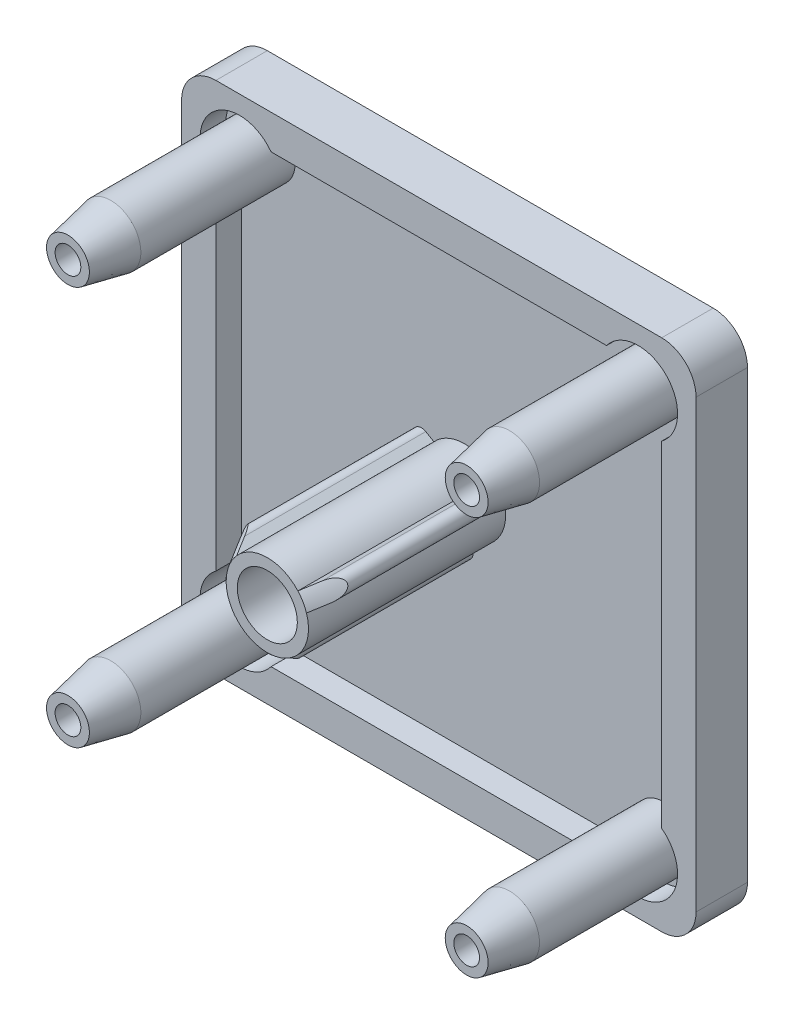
ISO-10303-21;
HEADER;
FILE_DESCRIPTION(('STEP AP214'),'2;1');
FILE_NAME('part.step','',(''),(''),'','','');
FILE_SCHEMA(('AUTOMOTIVE_DESIGN { 1 0 10303 214 1 1 1 1 }'));
ENDSEC;
DATA;
#1=APPLICATION_CONTEXT('core data for automotive mechanical design processes');
#2=APPLICATION_PROTOCOL_DEFINITION('international standard','automotive_design',2000,#1);
#3=PRODUCT_CONTEXT('',#1,'mechanical');
#4=PRODUCT('Part','Part','',(#3));
#5=PRODUCT_RELATED_PRODUCT_CATEGORY('part','',(#4));
#6=PRODUCT_DEFINITION_FORMATION('','',#4);
#7=PRODUCT_DEFINITION_CONTEXT('part definition',#1,'design');
#8=PRODUCT_DEFINITION('design','',#6,#7);
#9=PRODUCT_DEFINITION_SHAPE('','',#8);
#10=(LENGTH_UNIT() NAMED_UNIT(*) SI_UNIT(.MILLI.,.METRE.));
#11=(NAMED_UNIT(*) PLANE_ANGLE_UNIT() SI_UNIT($,.RADIAN.));
#12=(NAMED_UNIT(*) SI_UNIT($,.STERADIAN.) SOLID_ANGLE_UNIT());
#13=UNCERTAINTY_MEASURE_WITH_UNIT(LENGTH_MEASURE(1.E-05),#10,'distance_accuracy_value','');
#14=(GEOMETRIC_REPRESENTATION_CONTEXT(3) GLOBAL_UNCERTAINTY_ASSIGNED_CONTEXT((#13)) GLOBAL_UNIT_ASSIGNED_CONTEXT((#10,
#11,#12)) REPRESENTATION_CONTEXT('',''));
#15=CARTESIAN_POINT('',(0.,0.,0.));
#16=DIRECTION('',(0.,0.,1.));
#17=DIRECTION('',(1.,0.,0.));
#18=AXIS2_PLACEMENT_3D('',#15,#16,#17);
#19=CARTESIAN_POINT('',(0.,0.,10.));
#20=DIRECTION('',(0.,0.,1.));
#21=DIRECTION('',(1.,0.,0.));
#22=AXIS2_PLACEMENT_3D('',#19,#20,#21);
#23=PLANE('',#22);
#24=CARTESIAN_POINT('',(0.,0.,10.));
#25=DIRECTION('',(0.,0.,1.));
#26=DIRECTION('',(1.,0.,0.));
#27=AXIS2_PLACEMENT_3D('',#24,#25,#26);
#28=CIRCLE('',#27,1.75);
#29=CARTESIAN_POINT('',(1.75,0.,10.));
#30=VERTEX_POINT('',#29);
#31=EDGE_CURVE('E285',#30,#30,#28,.T.);
#32=ORIENTED_EDGE('',*,*,#31,.F.);
#33=EDGE_LOOP('',(#32));
#34=FACE_BOUND('',#33,.T.);
#35=CARTESIAN_POINT('',(0.,0.,10.));
#36=DIRECTION('',(0.,0.,1.));
#37=DIRECTION('',(1.,0.,0.));
#38=AXIS2_PLACEMENT_3D('',#35,#36,#37);
#39=CIRCLE('',#38,2.4);
#40=CARTESIAN_POINT('',(0.499992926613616,-2.34734042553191,10.));
#41=VERTEX_POINT('',#40);
#42=CARTESIAN_POINT('',(2.28285513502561,0.740656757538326,10.));
#43=VERTEX_POINT('',#42);
#44=EDGE_CURVE('E287',#41,#43,#39,.T.);
#45=ORIENTED_EDGE('',*,*,#44,.T.);
#46=CARTESIAN_POINT('',(0.,0.,10.));
#47=DIRECTION('',(0.,0.,-1.));
#48=DIRECTION('',(-1.,0.,0.));
#49=AXIS2_PLACEMENT_3D('',#46,#47,#48);
#50=CIRCLE('',#49,2.4);
#51=CARTESIAN_POINT('',(1.78285513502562,1.60668216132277,10.));
#52=VERTEX_POINT('',#51);
#53=EDGE_CURVE('E269',#52,#43,#50,.T.);
#54=ORIENTED_EDGE('',*,*,#53,.F.);
#55=CARTESIAN_POINT('',(-1.78285513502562,1.60668216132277,10.));
#56=VERTEX_POINT('',#55);
#57=EDGE_CURVE('E268',#52,#56,#39,.T.);
#58=ORIENTED_EDGE('',*,*,#57,.T.);
#59=CARTESIAN_POINT('',(-2.28285513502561,0.740656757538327,10.));
#60=VERTEX_POINT('',#59);
#61=EDGE_CURVE('E248',#60,#56,#50,.T.);
#62=ORIENTED_EDGE('',*,*,#61,.F.);
#63=CARTESIAN_POINT('',(-0.499992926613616,-2.34734042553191,10.));
#64=VERTEX_POINT('',#63);
#65=EDGE_CURVE('E264',#60,#64,#39,.T.);
#66=ORIENTED_EDGE('',*,*,#65,.T.);
#67=EDGE_CURVE('E271',#41,#64,#50,.T.);
#68=ORIENTED_EDGE('',*,*,#67,.F.);
#69=EDGE_LOOP('',(#45,#54,#58,#62,#66,#68));
#70=FACE_BOUND('',#69,.T.);
#71=ADVANCED_FACE('F61',(#34,#70),#23,.T.);
#72=CARTESIAN_POINT('',(-0.499992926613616,-2.34734042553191,-500000.));
#73=DIRECTION('',(1.,0.,0.));
#74=DIRECTION('',(0.,0.,-1.));
#75=AXIS2_PLACEMENT_3D('',#72,#73,#74);
#76=PLANE('',#75);
#77=CARTESIAN_POINT('',(-0.499992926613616,-1.07675647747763,12.1006650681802));
#78=CARTESIAN_POINT('',(-0.499992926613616,-1.11217835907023,12.0450084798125));
#79=CARTESIAN_POINT('',(-0.499992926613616,-1.14738944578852,11.9892185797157));
#80=CARTESIAN_POINT('',(-0.499992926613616,-1.21746949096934,11.8774252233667));
#81=CARTESIAN_POINT('',(-0.499992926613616,-1.25233845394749,11.8214217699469));
#82=CARTESIAN_POINT('',(-0.499992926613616,-1.35655020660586,11.6531725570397));
#83=CARTESIAN_POINT('',(-0.499992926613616,-1.42550043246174,11.5406838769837));
#84=CARTESIAN_POINT('',(-0.499992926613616,-1.56271596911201,11.3153008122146));
#85=CARTESIAN_POINT('',(-0.499992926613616,-1.63098132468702,11.2024064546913));
#86=CARTESIAN_POINT('',(-0.499992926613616,-1.76703837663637,10.9763311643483));
#87=CARTESIAN_POINT('',(-0.499992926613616,-1.83483006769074,10.8631502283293));
#88=CARTESIAN_POINT('',(-0.499992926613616,-2.068577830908,10.4716031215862));
#89=CARTESIAN_POINT('',(-0.499992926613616,-2.23370097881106,10.1927401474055));
#90=CARTESIAN_POINT('',(-0.499992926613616,-2.56296103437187,9.63441918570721));
#91=CARTESIAN_POINT('',(-0.499992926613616,-2.72709790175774,9.35496117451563));
#92=CARTESIAN_POINT('',(-0.499992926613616,-3.03954985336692,8.8216950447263));
#93=CARTESIAN_POINT('',(-0.499992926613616,-3.18791726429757,8.56791758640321));
#94=CARTESIAN_POINT('',(-0.499992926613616,-3.48433416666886,8.06017716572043));
#95=CARTESIAN_POINT('',(-0.499992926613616,-3.63238365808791,7.80621420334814));
#96=CARTESIAN_POINT('',(-0.499992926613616,-3.92824971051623,7.29818434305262));
#97=CARTESIAN_POINT('',(-0.499992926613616,-4.07606629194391,7.04411745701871));
#98=CARTESIAN_POINT('',(-0.499992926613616,-4.37153744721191,6.53588978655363));
#99=CARTESIAN_POINT('',(-0.499992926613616,-4.51919202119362,6.28172900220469));
#100=CARTESIAN_POINT('',(-0.499992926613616,-4.66679426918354,6.0275378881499));
#101=B_SPLINE_CURVE_WITH_KNOTS('',3,(#77,#78,#79,#80,#81,#82,#83,#84,#85,#86,#87,#88,#89,#90,
#91,#92,#93,#94,#95,#96,#97,#98,#99,#100),.UNSPECIFIED.,.F.,.F.,(4,2,2,2,2,2,2,2,2,2,2,4),(0.,
0.197915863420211,0.395829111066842,0.791641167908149,1.18742717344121,1.5832176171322,
2.55546320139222,3.52774821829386,4.40964516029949,5.29154216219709,6.17335699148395,
7.05517105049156),.UNSPECIFIED.);
#102=CARTESIAN_POINT('',(-0.499992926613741,-2.89734042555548,9.06440552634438));
#103=VERTEX_POINT('',#102);
#104=EDGE_CURVE('E522',#64,#103,#101,.T.);
#105=ORIENTED_EDGE('',*,*,#104,.F.);
#106=DIRECTION('',(0.,0.,1.));
#107=VECTOR('',#106,1.);
#108=CARTESIAN_POINT('',(-0.499992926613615,-2.34734042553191,-500000.));
#109=LINE('',#108,#107);
#110=CARTESIAN_POINT('',(-0.499992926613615,-2.34734042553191,-1.50000000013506));
#111=VERTEX_POINT('',#110);
#112=EDGE_CURVE('E284',#111,#64,#109,.T.);
#113=ORIENTED_EDGE('',*,*,#112,.F.);
#114=DIRECTION('',(0.,1.,0.));
#115=VECTOR('',#114,1.);
#116=CARTESIAN_POINT('',(-0.499992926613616,-2.34734042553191,-1.50000000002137));
#117=LINE('',#116,#115);
#118=CARTESIAN_POINT('',(-0.499992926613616,-2.89734042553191,-1.50000000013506));
#119=VERTEX_POINT('',#118);
#120=EDGE_CURVE('E1144',#119,#111,#117,.T.);
#121=ORIENTED_EDGE('',*,*,#120,.F.);
#122=DIRECTION('',(0.,0.,1.));
#123=VECTOR('',#122,1.);
#124=CARTESIAN_POINT('',(-0.499992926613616,-2.89734042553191,-500000.));
#125=LINE('',#124,#123);
#126=EDGE_CURVE('E1147',#119,#103,#125,.T.);
#127=ORIENTED_EDGE('',*,*,#126,.T.);
#128=EDGE_LOOP('',(#105,#113,#121,#127));
#129=FACE_BOUND('',#128,.T.);
#130=ADVANCED_FACE('F534',(#129),#76,.F.);
#131=CARTESIAN_POINT('',(0.499992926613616,-2.34734042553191,-500000.));
#132=DIRECTION('',(-1.,0.,0.));
#133=DIRECTION('',(0.,0.,1.));
#134=AXIS2_PLACEMENT_3D('',#131,#132,#133);
#135=PLANE('',#134);
#136=CARTESIAN_POINT('',(0.499992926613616,-4.66679426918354,6.0275378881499));
#137=CARTESIAN_POINT('',(0.499992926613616,-4.51918151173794,6.28174708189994));
#138=CARTESIAN_POINT('',(0.499992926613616,-4.37151643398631,6.5359259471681));
#139=CARTESIAN_POINT('',(0.499992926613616,-4.07602545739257,7.04418767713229));
#140=CARTESIAN_POINT('',(0.499992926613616,-3.92819955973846,7.29827054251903));
#141=CARTESIAN_POINT('',(0.499992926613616,-3.63233460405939,7.80629834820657));
#142=CARTESIAN_POINT('',(0.499992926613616,-3.48429555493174,8.06024329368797));
#143=CARTESIAN_POINT('',(0.499992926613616,-3.18789853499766,8.56794967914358));
#144=CARTESIAN_POINT('',(0.499992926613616,-3.03954056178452,8.82171111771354));
#145=CARTESIAN_POINT('',(0.499992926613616,-2.74232847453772,9.32896672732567));
#146=CARTESIAN_POINT('',(0.499992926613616,-2.59347432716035,9.5824608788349));
#147=CARTESIAN_POINT('',(0.499992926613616,-2.29498609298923,10.0889845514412));
#148=CARTESIAN_POINT('',(0.499992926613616,-2.14535202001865,10.3420140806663));
#149=CARTESIAN_POINT('',(0.499992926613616,-1.91981544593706,10.7209249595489));
#150=CARTESIAN_POINT('',(0.499992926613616,-1.84445297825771,10.8471274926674));
#151=CARTESIAN_POINT('',(0.499992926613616,-1.69320715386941,11.0992182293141));
#152=CARTESIAN_POINT('',(0.499992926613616,-1.61732380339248,11.2251064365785));
#153=CARTESIAN_POINT('',(0.499992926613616,-1.46478231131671,11.4764251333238));
#154=CARTESIAN_POINT('',(0.499992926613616,-1.38812411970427,11.601855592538));
#155=CARTESIAN_POINT('',(0.499992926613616,-1.27221358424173,11.7894349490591));
#156=CARTESIAN_POINT('',(0.499992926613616,-1.23342207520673,11.851868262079));
#157=CARTESIAN_POINT('',(0.499992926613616,-1.15542560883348,11.9764773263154));
#158=CARTESIAN_POINT('',(0.499992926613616,-1.11622064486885,12.0386530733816));
#159=CARTESIAN_POINT('',(0.499992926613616,-1.07675647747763,12.1006650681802));
#160=B_SPLINE_CURVE_WITH_KNOTS('',3,(#136,#137,#138,#139,#140,#141,#142,#143,#144,#145,#146,
#147,#148,#149,#150,#151,#152,#153,#154,#155,#156,#157,#158,#159),.UNSPECIFIED.,.F.,.F.,(4,2,2,
2,2,2,2,2,2,2,2,4),(0.,0.881876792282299,1.7637471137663,2.64558163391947,3.52742283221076,
4.40932453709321,5.29121066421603,5.73218508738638,6.17315424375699,6.61415204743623,
6.83465981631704,7.05517112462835),.UNSPECIFIED.);
#161=CARTESIAN_POINT('',(0.499992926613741,-2.89734042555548,9.06440552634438));
#162=VERTEX_POINT('',#161);
#163=EDGE_CURVE('E516',#162,#41,#160,.T.);
#164=ORIENTED_EDGE('',*,*,#163,.F.);
#165=DIRECTION('',(0.,0.,1.));
#166=VECTOR('',#165,1.);
#167=CARTESIAN_POINT('',(0.499992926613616,-2.89734042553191,-500000.));
#168=LINE('',#167,#166);
#169=CARTESIAN_POINT('',(0.499992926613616,-2.89734042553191,-1.50000000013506));
#170=VERTEX_POINT('',#169);
#171=EDGE_CURVE('E1159',#170,#162,#168,.T.);
#172=ORIENTED_EDGE('',*,*,#171,.F.);
#173=DIRECTION('',(0.,-1.,0.));
#174=VECTOR('',#173,1.);
#175=CARTESIAN_POINT('',(0.499992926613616,-2.34734042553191,-1.50000000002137));
#176=LINE('',#175,#174);
#177=CARTESIAN_POINT('',(0.499992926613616,-2.34734042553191,-1.50000000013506));
#178=VERTEX_POINT('',#177);
#179=EDGE_CURVE('E1152',#178,#170,#176,.T.);
#180=ORIENTED_EDGE('',*,*,#179,.F.);
#181=DIRECTION('',(0.,0.,1.));
#182=VECTOR('',#181,1.);
#183=CARTESIAN_POINT('',(0.499992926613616,-2.34734042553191,-500000.));
#184=LINE('',#183,#182);
#185=EDGE_CURVE('E1146',#178,#41,#184,.T.);
#186=ORIENTED_EDGE('',*,*,#185,.T.);
#187=EDGE_LOOP('',(#164,#172,#180,#186));
#188=FACE_BOUND('',#187,.T.);
#189=ADVANCED_FACE('F529',(#188),#135,.F.);
#190=CARTESIAN_POINT('',(0.,-2.9,-500000.));
#191=DIRECTION('',(0.,0.,1.));
#192=DIRECTION('',(1.,0.,0.));
#193=AXIS2_PLACEMENT_3D('',#190,#191,#192);
#194=CYLINDRICAL_SURFACE('',#193,0.5);
#195=CARTESIAN_POINT('',(-0.499991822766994,-2.89714042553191,9.06474721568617));
#196=CARTESIAN_POINT('',(-0.500095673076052,-2.9183825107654,9.02845214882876));
#197=CARTESIAN_POINT('',(-0.498880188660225,-2.93980752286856,8.99223828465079));
#198=CARTESIAN_POINT('',(-0.493555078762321,-2.98296168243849,8.92004953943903));
#199=CARTESIAN_POINT('',(-0.489436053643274,-3.00469159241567,8.88407581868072));
#200=CARTESIAN_POINT('',(-0.478008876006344,-3.04839004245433,8.81245950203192));
#201=CARTESIAN_POINT('',(-0.470680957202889,-3.0703592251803,8.77682037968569));
#202=CARTESIAN_POINT('',(-0.452433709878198,-3.11416556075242,8.70644352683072));
#203=CARTESIAN_POINT('',(-0.441519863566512,-3.13600286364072,8.67170450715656));
#204=CARTESIAN_POINT('',(-0.418245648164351,-3.1747137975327,8.61068477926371));
#205=CARTESIAN_POINT('',(-0.406668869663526,-3.19166780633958,8.5841583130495));
#206=CARTESIAN_POINT('',(-0.38050271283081,-3.22506625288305,8.53225973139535));
#207=CARTESIAN_POINT('',(-0.365912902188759,-3.24151061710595,8.50688778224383));
#208=CARTESIAN_POINT('',(-0.333053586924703,-3.27364385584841,8.4576223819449));
#209=CARTESIAN_POINT('',(-0.314749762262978,-3.28932385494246,8.43374565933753));
#210=CARTESIAN_POINT('',(-0.273916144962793,-3.31905257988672,8.38873189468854));
#211=CARTESIAN_POINT('',(-0.251398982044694,-3.33310598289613,8.36758697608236));
#212=CARTESIAN_POINT('',(-0.211919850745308,-3.35316232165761,8.33754484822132));
#213=CARTESIAN_POINT('',(-0.196529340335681,-3.36008617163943,8.32720605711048));
#214=CARTESIAN_POINT('',(-0.164075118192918,-3.37263266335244,8.30851230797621));
#215=CARTESIAN_POINT('',(-0.147011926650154,-3.3782557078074,8.30015673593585));
#216=CARTESIAN_POINT('',(-0.111154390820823,-3.38784479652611,8.28592957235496));
#217=CARTESIAN_POINT('',(-0.0923414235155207,-3.3917897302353,8.28008961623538));
#218=CARTESIAN_POINT('',(-0.0536867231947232,-3.39749070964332,8.27165583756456));
#219=CARTESIAN_POINT('',(-0.0338468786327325,-3.39925063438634,8.26905626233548));
#220=CARTESIAN_POINT('',(0.0031339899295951,-3.40028166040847,8.26753309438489));
#221=CARTESIAN_POINT('',(0.0202477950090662,-3.39987755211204,8.26812979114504));
#222=CARTESIAN_POINT('',(0.0540687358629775,-3.39735715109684,8.27185457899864));
#223=CARTESIAN_POINT('',(0.0707757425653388,-3.39524032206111,8.27498346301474));
#224=CARTESIAN_POINT('',(0.102400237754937,-3.38965096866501,8.28325676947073));
#225=CARTESIAN_POINT('',(0.117365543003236,-3.38626106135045,8.28827842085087));
#226=CARTESIAN_POINT('',(0.146291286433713,-3.37835548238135,8.30000978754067));
#227=CARTESIAN_POINT('',(0.1602514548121,-3.37383950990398,8.30671995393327));
#228=CARTESIAN_POINT('',(0.195417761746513,-3.36081482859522,8.32611408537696));
#229=CARTESIAN_POINT('',(0.21573295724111,-3.35156930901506,8.33991840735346));
#230=CARTESIAN_POINT('',(0.25352999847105,-3.33148917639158,8.37002805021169));
#231=CARTESIAN_POINT('',(0.27100328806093,-3.32064994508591,8.38634064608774));
#232=CARTESIAN_POINT('',(0.313684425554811,-3.29070762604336,8.431618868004));
#233=CARTESIAN_POINT('',(0.336735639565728,-3.270736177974,8.46202900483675));
#234=CARTESIAN_POINT('',(0.377249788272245,-3.2294243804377,8.52549210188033));
#235=CARTESIAN_POINT('',(0.394698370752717,-3.20808068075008,8.55855158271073));
#236=CARTESIAN_POINT('',(0.423233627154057,-3.16724265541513,8.62240106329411));
#237=CARTESIAN_POINT('',(0.43482068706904,-3.14781730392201,8.6530159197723));
#238=CARTESIAN_POINT('',(0.454870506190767,-3.10874548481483,8.71512628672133));
#239=CARTESIAN_POINT('',(0.463330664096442,-3.08909884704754,8.74662250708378));
#240=CARTESIAN_POINT('',(0.484578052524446,-3.03013625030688,8.84199998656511));
#241=CARTESIAN_POINT('',(0.493248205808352,-2.99077267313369,8.9068089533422));
#242=CARTESIAN_POINT('',(0.498257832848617,-2.94269988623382,8.98747136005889));
#243=CARTESIAN_POINT('',(0.498957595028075,-2.93353474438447,9.00291906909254));
#244=CARTESIAN_POINT('',(0.499850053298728,-2.9152841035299,9.03381938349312));
#245=CARTESIAN_POINT('',(0.500044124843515,-2.9061984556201,9.04927186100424));
#246=CARTESIAN_POINT('',(0.499991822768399,-2.89714042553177,9.064747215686));
#247=B_SPLINE_CURVE_WITH_KNOTS('',3,(#195,#196,#197,#198,#199,#200,#201,#202,#203,#204,#205,
#206,#207,#208,#209,#210,#211,#212,#213,#214,#215,#216,#217,#218,#219,#220,#221,#222,#223,#224,
#225,#226,#227,#228,#229,#230,#231,#232,#233,#234,#235,#236,#237,#238,#239,#240,#241,#242,#243,
#244,#245,#246),.UNSPECIFIED.,.F.,.F.,(4,2,2,2,2,2,2,2,2,2,2,2,2,2,2,2,2,2,2,2,2,2,2,2,2,4),(0.,
0.12617043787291,0.252751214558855,0.380122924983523,0.507300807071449,0.607802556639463,
0.70831873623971,0.809809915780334,0.91100160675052,0.970207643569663,1.0293953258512,
1.08930701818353,1.14911219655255,1.20021800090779,1.25133981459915,1.29959688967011,
1.34786687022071,1.42614632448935,1.50465725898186,1.63314412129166,1.76195754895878,
1.87598349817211,1.99010409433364,2.21820009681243,2.2721263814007,2.32590583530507),.UNSPECIFIED.);
#248=EDGE_CURVE('E509',#103,#162,#247,.T.);
#249=ORIENTED_EDGE('',*,*,#248,.F.);
#250=ORIENTED_EDGE('',*,*,#126,.F.);
#251=CARTESIAN_POINT('',(0.,-2.9,-1.50000000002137));
#252=DIRECTION('',(0.,0.,-1.));
#253=DIRECTION('',(-1.,0.,0.));
#254=AXIS2_PLACEMENT_3D('',#251,#252,#253);
#255=CIRCLE('',#254,0.5);
#256=EDGE_CURVE('E1151',#170,#119,#255,.T.);
#257=ORIENTED_EDGE('',*,*,#256,.F.);
#258=ORIENTED_EDGE('',*,*,#171,.T.);
#259=EDGE_LOOP('',(#249,#250,#257,#258));
#260=FACE_BOUND('',#259,.T.);
#261=ADVANCED_FACE('F533',(#260),#194,.T.);
#262=CARTESIAN_POINT('',(2.75916910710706,1.01565675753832,-500000.));
#263=DIRECTION('',(-0.499999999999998,0.86602540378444,0.));
#264=DIRECTION('',(-0.86602540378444,-0.499999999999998,0.));
#265=AXIS2_PLACEMENT_3D('',#262,#263,#264);
#266=PLANE('',#265);
#267=CARTESIAN_POINT('',(2.28275289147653,0.740597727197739,10.0002));
#268=CARTESIAN_POINT('',(2.36240846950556,0.786586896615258,9.84431765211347));
#269=CARTESIAN_POINT('',(2.4419542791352,0.832512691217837,9.68836079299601));
#270=CARTESIAN_POINT('',(2.60082635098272,0.92423752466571,9.37629807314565));
#271=CARTESIAN_POINT('',(2.68015261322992,0.970036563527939,9.22019221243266));
#272=CARTESIAN_POINT('',(2.75936910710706,1.01577222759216,9.06401184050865));
#273=B_SPLINE_CURVE_WITH_KNOTS('',3,(#267,#268,#269,#270,#271,#272),.UNSPECIFIED.,.F.,.F.,(4,2,
4),(0.,0.542985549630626,1.08597102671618),.UNSPECIFIED.);
#274=CARTESIAN_POINT('',(2.75916910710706,1.01565675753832,9.06440601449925));
#275=VERTEX_POINT('',#274);
#276=EDGE_CURVE('E502',#43,#275,#273,.T.);
#277=ORIENTED_EDGE('',*,*,#276,.F.);
#278=DIRECTION('',(0.,0.,1.));
#279=VECTOR('',#278,1.);
#280=CARTESIAN_POINT('',(2.28285513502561,0.740656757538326,-500000.));
#281=LINE('',#280,#279);
#282=CARTESIAN_POINT('',(2.28285513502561,0.740656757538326,-1.50000000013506));
#283=VERTEX_POINT('',#282);
#284=EDGE_CURVE('E1180',#283,#43,#281,.T.);
#285=ORIENTED_EDGE('',*,*,#284,.F.);
#286=DIRECTION('',(-0.86602540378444,-0.499999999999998,0.));
#287=VECTOR('',#286,1.);
#288=CARTESIAN_POINT('',(2.75916910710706,1.01565675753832,-1.50000000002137));
#289=LINE('',#288,#287);
#290=CARTESIAN_POINT('',(2.75916910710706,1.01565675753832,-1.50000000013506));
#291=VERTEX_POINT('',#290);
#292=EDGE_CURVE('E1170',#291,#283,#289,.T.);
#293=ORIENTED_EDGE('',*,*,#292,.F.);
#294=DIRECTION('',(0.,0.,1.));
#295=VECTOR('',#294,1.);
#296=CARTESIAN_POINT('',(2.75916910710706,1.01565675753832,-500000.));
#297=LINE('',#296,#295);
#298=EDGE_CURVE('E1176',#291,#275,#297,.T.);
#299=ORIENTED_EDGE('',*,*,#298,.T.);
#300=EDGE_LOOP('',(#277,#285,#293,#299));
#301=FACE_BOUND('',#300,.T.);
#302=ADVANCED_FACE('F876',(#301),#266,.F.);
#303=CARTESIAN_POINT('',(2.25916910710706,1.88168216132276,-500000.));
#304=DIRECTION('',(0.499999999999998,-0.86602540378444,0.));
#305=DIRECTION('',(0.86602540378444,0.499999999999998,0.));
#306=AXIS2_PLACEMENT_3D('',#303,#304,#305);
#307=PLANE('',#306);
#308=CARTESIAN_POINT('',(2.25936910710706,1.8817976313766,9.06401184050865));
#309=CARTESIAN_POINT('',(2.18015261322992,1.83606196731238,9.22019221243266));
#310=CARTESIAN_POINT('',(2.10082635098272,1.79026292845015,9.37629807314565));
#311=CARTESIAN_POINT('',(1.94195427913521,1.69853809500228,9.68836079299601));
#312=CARTESIAN_POINT('',(1.86240846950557,1.6526123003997,9.84431765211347));
#313=CARTESIAN_POINT('',(1.78275289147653,1.60662313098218,10.0002));
#314=B_SPLINE_CURVE_WITH_KNOTS('',3,(#308,#309,#310,#311,#312,#313),.UNSPECIFIED.,.F.,.F.,(4,2,
4),(0.,0.542985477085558,1.08597102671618),.UNSPECIFIED.);
#315=CARTESIAN_POINT('',(2.25916910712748,1.88168216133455,9.06440601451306));
#316=VERTEX_POINT('',#315);
#317=EDGE_CURVE('E494',#316,#52,#314,.T.);
#318=ORIENTED_EDGE('',*,*,#317,.F.);
#319=DIRECTION('',(0.,0.,1.));
#320=VECTOR('',#319,1.);
#321=CARTESIAN_POINT('',(2.25916910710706,1.88168216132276,-500000.));
#322=LINE('',#321,#320);
#323=CARTESIAN_POINT('',(2.25916910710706,1.88168216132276,-1.50000000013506));
#324=VERTEX_POINT('',#323);
#325=EDGE_CURVE('E1155',#324,#316,#322,.T.);
#326=ORIENTED_EDGE('',*,*,#325,.F.);
#327=DIRECTION('',(0.86602540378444,0.499999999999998,0.));
#328=VECTOR('',#327,1.);
#329=CARTESIAN_POINT('',(2.25916910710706,1.88168216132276,-1.50000000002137));
#330=LINE('',#329,#328);
#331=CARTESIAN_POINT('',(1.78285513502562,1.60668216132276,-1.50000000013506));
#332=VERTEX_POINT('',#331);
#333=EDGE_CURVE('E1168',#332,#324,#330,.T.);
#334=ORIENTED_EDGE('',*,*,#333,.F.);
#335=DIRECTION('',(0.,0.,1.));
#336=VECTOR('',#335,1.);
#337=CARTESIAN_POINT('',(1.78285513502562,1.60668216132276,-500000.));
#338=LINE('',#337,#336);
#339=EDGE_CURVE('E1140',#332,#52,#338,.T.);
#340=ORIENTED_EDGE('',*,*,#339,.T.);
#341=EDGE_LOOP('',(#318,#326,#334,#340));
#342=FACE_BOUND('',#341,.T.);
#343=ADVANCED_FACE('F867',(#342),#307,.F.);
#344=CARTESIAN_POINT('',(2.50916910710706,1.44866945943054,-500000.));
#345=DIRECTION('',(0.,0.,1.));
#346=DIRECTION('',(1.,0.,0.));
#347=AXIS2_PLACEMENT_3D('',#344,#345,#346);
#348=CYLINDRICAL_SURFACE('',#347,0.5);
#349=CARTESIAN_POINT('',(2.52978148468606,0.949094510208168,9.47699413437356));
#350=CARTESIAN_POINT('',(2.55028518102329,0.94995644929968,9.44321207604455));
#351=CARTESIAN_POINT('',(2.57042621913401,0.952036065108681,9.40925251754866));
#352=CARTESIAN_POINT('',(2.60996217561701,0.958520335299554,9.34112185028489));
#353=CARTESIAN_POINT('',(2.6293571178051,0.962924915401,9.3069507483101));
#354=CARTESIAN_POINT('',(2.66761254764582,0.974015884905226,9.23812237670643));
#355=CARTESIAN_POINT('',(2.68646367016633,0.98072936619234,9.20346424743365));
#356=CARTESIAN_POINT('',(2.7233049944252,0.99640185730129,9.13421129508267));
#357=CARTESIAN_POINT('',(2.74129517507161,1.00536092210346,9.09961647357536));
#358=CARTESIAN_POINT('',(2.79596071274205,1.03684879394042,8.99192965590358));
#359=CARTESIAN_POINT('',(2.83102039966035,1.06334461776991,8.91907360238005));
#360=CARTESIAN_POINT('',(2.87897038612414,1.11139889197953,8.81175549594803));
#361=CARTESIAN_POINT('',(2.89415124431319,1.12875337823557,8.77638845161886));
#362=CARTESIAN_POINT('',(2.92261676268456,1.16649762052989,8.7065320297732));
#363=CARTESIAN_POINT('',(2.93590319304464,1.1868845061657,8.67204185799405));
#364=CARTESIAN_POINT('',(2.95746024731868,1.22634735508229,8.61156057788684));
#365=CARTESIAN_POINT('',(2.96619692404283,1.24478315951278,8.58531930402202));
#366=CARTESIAN_POINT('',(2.98174589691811,1.28399738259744,8.53396051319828));
#367=CARTESIAN_POINT('',(2.98855587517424,1.30477858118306,8.50884438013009));
#368=CARTESIAN_POINT('',(2.99969385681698,1.34910251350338,8.46010377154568));
#369=CARTESIAN_POINT('',(3.00399872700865,1.37266864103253,8.43649493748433));
#370=CARTESIAN_POINT('',(3.00911669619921,1.42260013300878,8.39199940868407));
#371=CARTESIAN_POINT('',(3.00993985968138,1.44895720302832,8.37110503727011));
#372=CARTESIAN_POINT('',(3.007469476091,1.49297242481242,8.34135285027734));
#373=CARTESIAN_POINT('',(3.00572882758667,1.50975364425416,8.33107747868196));
#374=CARTESIAN_POINT('',(3.00028437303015,1.54410403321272,8.31251687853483));
#375=CARTESIAN_POINT('',(2.99658135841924,1.56167288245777,8.3042308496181));
#376=CARTESIAN_POINT('',(2.9868785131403,1.59746790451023,8.29014684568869));
#377=CARTESIAN_POINT('',(2.98085120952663,1.61569948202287,8.28438046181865));
#378=CARTESIAN_POINT('',(2.96639676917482,1.65194560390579,8.27608990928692));
#379=CARTESIAN_POINT('',(2.95797376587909,1.66996046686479,8.2735601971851));
#380=CARTESIAN_POINT('',(2.94034011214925,1.70240569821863,8.27215483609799));
#381=CARTESIAN_POINT('',(2.93142218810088,1.71697633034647,8.27280124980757));
#382=CARTESIAN_POINT('',(2.91231899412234,1.74490659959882,8.27661177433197));
#383=CARTESIAN_POINT('',(2.90213333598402,1.75826586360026,8.27977665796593));
#384=CARTESIAN_POINT('',(2.88146425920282,1.78279564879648,8.28811679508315));
#385=CARTESIAN_POINT('',(2.87102579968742,1.79404496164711,8.29317564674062));
#386=CARTESIAN_POINT('',(2.84968061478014,1.81510777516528,8.30497806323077));
#387=CARTESIAN_POINT('',(2.83877376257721,1.82492088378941,8.31172208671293));
#388=CARTESIAN_POINT('',(2.80983293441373,1.84884698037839,8.33122793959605));
#389=CARTESIAN_POINT('',(2.79160777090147,1.86181074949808,8.34511548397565));
#390=CARTESIAN_POINT('',(2.75520506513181,1.88447727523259,8.37539324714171));
#391=CARTESIAN_POINT('',(2.73702782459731,1.89417024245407,8.39179076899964));
#392=CARTESIAN_POINT('',(2.68959911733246,1.91611031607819,8.43731615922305));
#393=CARTESIAN_POINT('',(2.660680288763,1.92604226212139,8.4678921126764));
#394=CARTESIAN_POINT('',(2.60446723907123,1.94036072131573,8.53168857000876));
#395=CARTESIAN_POINT('',(2.57717739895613,1.94473287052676,8.56491568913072));
#396=CARTESIAN_POINT('',(2.52740266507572,1.9488851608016,8.62908182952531));
#397=CARTESIAN_POINT('',(2.50472573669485,1.94913464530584,8.65984591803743));
#398=CARTESIAN_POINT('',(2.46075335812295,1.94680625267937,8.72225453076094));
#399=CARTESIAN_POINT('',(2.43945908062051,1.94422600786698,8.75389977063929));
#400=CARTESIAN_POINT('',(2.37765762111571,1.93288550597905,8.84969261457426));
#401=CARTESIAN_POINT('',(2.33918364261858,1.92052759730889,8.91476077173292));
#402=CARTESIAN_POINT('',(2.28812185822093,1.89746523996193,9.00836990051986));
#403=CARTESIAN_POINT('',(2.27329761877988,1.88984617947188,9.03655201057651));
#404=CARTESIAN_POINT('',(2.23450043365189,1.86742771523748,9.11303953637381));
#405=CARTESIAN_POINT('',(2.21147740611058,1.85136267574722,9.16147168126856));
#406=CARTESIAN_POINT('',(2.16842353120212,1.81565009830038,9.25835659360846));
#407=CARTESIAN_POINT('',(2.14839413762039,1.79600082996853,9.30680935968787));
#408=CARTESIAN_POINT('',(2.11130118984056,1.75284491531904,9.40401775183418));
#409=CARTESIAN_POINT('',(2.09428019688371,1.72929084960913,9.45276895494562));
#410=CARTESIAN_POINT('',(2.07157212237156,1.69100944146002,9.52521627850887));
#411=CARTESIAN_POINT('',(2.06447244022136,1.67775494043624,9.54925586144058));
#412=CARTESIAN_POINT('',(2.05131627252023,1.65017008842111,9.59701444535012));
#413=CARTESIAN_POINT('',(2.0452602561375,1.63583925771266,9.62073329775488));
#414=CARTESIAN_POINT('',(2.0397796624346,1.62092958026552,9.64423522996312));
#415=B_SPLINE_CURVE_WITH_KNOTS('',3,(#349,#350,#351,#352,#353,#354,#355,#356,#357,#358,#359,
#360,#361,#362,#363,#364,#365,#366,#367,#368,#369,#370,#371,#372,#373,#374,#375,#376,#377,#378,
#379,#380,#381,#382,#383,#384,#385,#386,#387,#388,#389,#390,#391,#392,#393,#394,#395,#396,#397,
#398,#399,#400,#401,#402,#403,#404,#405,#406,#407,#408,#409,#410,#411,#412,#413,#414),
.UNSPECIFIED.,.F.,.F.,(4,2,2,2,2,2,2,2,2,2,2,2,2,2,2,2,2,2,2,2,2,2,2,2,2,2,2,2,2,2,2,2,4),(0.,
0.118544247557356,0.237084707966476,0.357066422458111,0.477051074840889,0.731286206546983,
0.857831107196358,0.98425697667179,1.08384944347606,1.18356121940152,1.28417973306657,
1.38450719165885,1.44360064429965,1.502670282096,1.56246064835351,1.6221484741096,
1.67315528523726,1.72417775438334,1.77247511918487,1.82078564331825,1.89931083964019,
1.97806901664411,2.10706878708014,2.23640116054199,2.35089332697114,2.46548136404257,
2.69442086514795,2.79262986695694,2.96034051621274,3.12813234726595,3.29813529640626,
3.38316348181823,3.46822979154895),.UNSPECIFIED.);
#416=EDGE_CURVE('E486',#275,#316,#415,.T.);
#417=ORIENTED_EDGE('',*,*,#416,.F.);
#418=ORIENTED_EDGE('',*,*,#298,.F.);
#419=CARTESIAN_POINT('',(2.50916910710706,1.44866945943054,-1.50000000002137));
#420=DIRECTION('',(0.,0.,-1.));
#421=DIRECTION('',(-1.,0.,0.));
#422=AXIS2_PLACEMENT_3D('',#419,#420,#421);
#423=CIRCLE('',#422,0.5);
#424=EDGE_CURVE('E1173',#324,#291,#423,.T.);
#425=ORIENTED_EDGE('',*,*,#424,.F.);
#426=ORIENTED_EDGE('',*,*,#325,.T.);
#427=EDGE_LOOP('',(#417,#418,#425,#426));
#428=FACE_BOUND('',#427,.T.);
#429=ADVANCED_FACE('F858',(#428),#348,.T.);
#430=CARTESIAN_POINT('',(-1.78285513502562,1.60668216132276,-500000.));
#431=DIRECTION('',(-0.499999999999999,-0.866025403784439,0.));
#432=DIRECTION('',(0.866025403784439,-0.499999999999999,0.));
#433=AXIS2_PLACEMENT_3D('',#430,#431,#432);
#434=PLANE('',#433);
#435=CARTESIAN_POINT('',(-1.78275289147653,1.60662313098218,10.0002));
#436=CARTESIAN_POINT('',(-1.86240846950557,1.6526123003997,9.84431765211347));
#437=CARTESIAN_POINT('',(-1.94195427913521,1.69853809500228,9.68836079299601));
#438=CARTESIAN_POINT('',(-2.10082635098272,1.79026292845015,9.37629807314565));
#439=CARTESIAN_POINT('',(-2.18015261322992,1.83606196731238,9.22019221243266));
#440=CARTESIAN_POINT('',(-2.25936910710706,1.8817976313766,9.06401184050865));
#441=B_SPLINE_CURVE_WITH_KNOTS('',3,(#435,#436,#437,#438,#439,#440),.UNSPECIFIED.,.F.,.F.,(4,2,
4),(0.,0.542985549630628,1.08597102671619),.UNSPECIFIED.);
#442=CARTESIAN_POINT('',(-2.25916910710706,1.88168216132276,9.06440601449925));
#443=VERTEX_POINT('',#442);
#444=EDGE_CURVE('E256',#56,#443,#441,.T.);
#445=ORIENTED_EDGE('',*,*,#444,.F.);
#446=DIRECTION('',(0.,0.,1.));
#447=VECTOR('',#446,1.);
#448=CARTESIAN_POINT('',(-1.78285513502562,1.60668216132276,-500000.));
#449=LINE('',#448,#447);
#450=CARTESIAN_POINT('',(-1.78285513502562,1.60668216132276,-1.50000000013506));
#451=VERTEX_POINT('',#450);
#452=EDGE_CURVE('E280',#451,#56,#449,.T.);
#453=ORIENTED_EDGE('',*,*,#452,.F.);
#454=DIRECTION('',(0.866025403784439,-0.499999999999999,0.));
#455=VECTOR('',#454,1.);
#456=CARTESIAN_POINT('',(-1.78285513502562,1.60668216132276,-1.50000000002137));
#457=LINE('',#456,#455);
#458=CARTESIAN_POINT('',(-2.25916910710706,1.88168216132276,-1.50000000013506));
#459=VERTEX_POINT('',#458);
#460=EDGE_CURVE('E1130',#459,#451,#457,.T.);
#461=ORIENTED_EDGE('',*,*,#460,.F.);
#462=DIRECTION('',(0.,0.,1.));
#463=VECTOR('',#462,1.);
#464=CARTESIAN_POINT('',(-2.25916910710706,1.88168216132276,-500000.));
#465=LINE('',#464,#463);
#466=EDGE_CURVE('E1187',#459,#443,#465,.T.);
#467=ORIENTED_EDGE('',*,*,#466,.T.);
#468=EDGE_LOOP('',(#445,#453,#461,#467));
#469=FACE_BOUND('',#468,.T.);
#470=ADVANCED_FACE('F467',(#469),#434,.F.);
#471=CARTESIAN_POINT('',(-2.28285513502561,0.740656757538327,-500000.));
#472=DIRECTION('',(0.499999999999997,0.86602540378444,0.));
#473=DIRECTION('',(-0.86602540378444,0.499999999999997,0.));
#474=AXIS2_PLACEMENT_3D('',#471,#472,#473);
#475=PLANE('',#474);
#476=CARTESIAN_POINT('',(-2.75936910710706,1.01577222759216,9.06401184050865));
#477=CARTESIAN_POINT('',(-2.68015261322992,0.97003656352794,9.22019221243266));
#478=CARTESIAN_POINT('',(-2.60082635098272,0.924237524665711,9.37629807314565));
#479=CARTESIAN_POINT('',(-2.4419542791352,0.832512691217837,9.68836079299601));
#480=CARTESIAN_POINT('',(-2.36240846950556,0.786586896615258,9.84431765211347));
#481=CARTESIAN_POINT('',(-2.28275289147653,0.740597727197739,10.0002));
#482=B_SPLINE_CURVE_WITH_KNOTS('',3,(#476,#477,#478,#479,#480,#481),.UNSPECIFIED.,.F.,.F.,(4,2,
4),(0.,0.542985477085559,1.08597102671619),.UNSPECIFIED.);
#483=CARTESIAN_POINT('',(-2.75916910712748,1.01565675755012,9.06440601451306));
#484=VERTEX_POINT('',#483);
#485=EDGE_CURVE('E245',#484,#60,#482,.T.);
#486=ORIENTED_EDGE('',*,*,#485,.F.);
#487=DIRECTION('',(0.,0.,1.));
#488=VECTOR('',#487,1.);
#489=CARTESIAN_POINT('',(-2.75916910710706,1.01565675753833,-500000.));
#490=LINE('',#489,#488);
#491=CARTESIAN_POINT('',(-2.75916910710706,1.01565675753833,-1.50000000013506));
#492=VERTEX_POINT('',#491);
#493=EDGE_CURVE('E279',#492,#484,#490,.T.);
#494=ORIENTED_EDGE('',*,*,#493,.F.);
#495=DIRECTION('',(-0.86602540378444,0.499999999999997,0.));
#496=VECTOR('',#495,1.);
#497=CARTESIAN_POINT('',(-2.28285513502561,0.740656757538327,-1.50000000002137));
#498=LINE('',#497,#496);
#499=CARTESIAN_POINT('',(-2.28285513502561,0.740656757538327,-1.50000000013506));
#500=VERTEX_POINT('',#499);
#501=EDGE_CURVE('E276',#500,#492,#498,.T.);
#502=ORIENTED_EDGE('',*,*,#501,.F.);
#503=DIRECTION('',(0.,0.,1.));
#504=VECTOR('',#503,1.);
#505=CARTESIAN_POINT('',(-2.28285513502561,0.740656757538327,-500000.));
#506=LINE('',#505,#504);
#507=EDGE_CURVE('E273',#500,#60,#506,.T.);
#508=ORIENTED_EDGE('',*,*,#507,.T.);
#509=EDGE_LOOP('',(#486,#494,#502,#508));
#510=FACE_BOUND('',#509,.T.);
#511=ADVANCED_FACE('F274',(#510),#475,.F.);
#512=CARTESIAN_POINT('',(-2.50916910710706,1.44866945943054,-500000.));
#513=DIRECTION('',(0.,0.,1.));
#514=DIRECTION('',(1.,0.,0.));
#515=AXIS2_PLACEMENT_3D('',#512,#513,#514);
#516=CYLINDRICAL_SURFACE('',#515,0.5);
#517=CARTESIAN_POINT('',(-2.08262607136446,1.70955456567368,9.49004669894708));
#518=CARTESIAN_POINT('',(-2.09374430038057,1.72769690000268,9.45521593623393));
#519=CARTESIAN_POINT('',(-2.10580468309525,1.74484796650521,9.42018345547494));
#520=CARTESIAN_POINT('',(-2.13168787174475,1.7772149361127,9.3498765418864));
#521=CARTESIAN_POINT('',(-2.14551061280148,1.79243091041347,9.31460211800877));
#522=CARTESIAN_POINT('',(-2.1749799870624,1.82115429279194,9.24353003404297));
#523=CARTESIAN_POINT('',(-2.19064720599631,1.83463804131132,9.20773133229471));
#524=CARTESIAN_POINT('',(-2.22359828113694,1.85961491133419,9.13619758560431));
#525=CARTESIAN_POINT('',(-2.24088216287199,1.87110800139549,9.10046254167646));
#526=CARTESIAN_POINT('',(-2.2960755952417,1.90302315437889,8.99163686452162));
#527=CARTESIAN_POINT('',(-2.33656209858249,1.92012572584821,8.91877970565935));
#528=CARTESIAN_POINT('',(-2.40216842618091,1.93760230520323,8.81146428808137));
#529=CARTESIAN_POINT('',(-2.42479206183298,1.94206400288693,8.77610038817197));
#530=CARTESIAN_POINT('',(-2.47171983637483,1.9478263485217,8.70625110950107));
#531=CARTESIAN_POINT('',(-2.49602237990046,1.94912995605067,8.67176493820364));
#532=CARTESIAN_POINT('',(-2.54097237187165,1.94804937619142,8.61130685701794));
#533=CARTESIAN_POINT('',(-2.56129789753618,1.9463905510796,8.58508405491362));
#534=CARTESIAN_POINT('',(-2.60301427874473,1.94023680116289,8.53376195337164));
#535=CARTESIAN_POINT('',(-2.62440638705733,1.93573846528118,8.50866404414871));
#536=CARTESIAN_POINT('',(-2.66833946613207,1.92321394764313,8.45995982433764));
#537=CARTESIAN_POINT('',(-2.69088910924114,1.91515608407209,8.43636913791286));
#538=CARTESIAN_POINT('',(-2.73666523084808,1.89462032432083,8.39190870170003));
#539=CARTESIAN_POINT('',(-2.75988956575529,1.88215526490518,8.37103128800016));
#540=CARTESIAN_POINT('',(-2.79675709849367,1.85800934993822,8.34129876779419));
#541=CARTESIAN_POINT('',(-2.81041764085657,1.84810923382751,8.33102773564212));
#542=CARTESIAN_POINT('',(-2.83743900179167,1.82621523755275,8.31247617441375));
#543=CARTESIAN_POINT('',(-2.85079993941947,1.81422220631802,8.30419484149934));
#544=CARTESIAN_POINT('',(-2.87694200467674,1.78791908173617,8.29012051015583));
#545=CARTESIAN_POINT('',(-2.88971407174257,1.77358250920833,8.28435909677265));
#546=CARTESIAN_POINT('',(-2.91386987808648,1.74294066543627,8.27607822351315));
#547=CARTESIAN_POINT('',(-2.92525595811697,1.72663880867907,8.27355322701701));
#548=CARTESIAN_POINT('',(-2.94453054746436,1.69514634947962,8.27215579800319));
#549=CARTESIAN_POINT('',(-2.95268689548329,1.68013894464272,8.27280555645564));
#550=CARTESIAN_POINT('',(-2.96731743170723,1.64963288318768,8.27662184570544));
#551=CARTESIAN_POINT('',(-2.97379110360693,1.63413407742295,8.2797891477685));
#552=CARTESIAN_POINT('',(-2.98469570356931,1.60397061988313,8.28813376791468));
#553=CARTESIAN_POINT('',(-2.98921703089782,1.58930548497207,8.29319510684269));
#554=CARTESIAN_POINT('',(-2.99678212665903,1.56028786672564,8.30500228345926));
#555=CARTESIAN_POINT('',(-2.99982548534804,1.54593547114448,8.31174858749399));
#556=CARTESIAN_POINT('',(-3.00607217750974,1.50890478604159,8.33126213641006));
#557=CARTESIAN_POINT('',(-3.00818413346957,1.48663594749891,8.34515550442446));
#558=CARTESIAN_POINT('',(-3.00960717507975,1.44377142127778,8.3754447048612));
#559=CARTESIAN_POINT('',(-3.00890999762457,1.42318085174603,8.39184778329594));
#560=CARTESIAN_POINT('',(-3.00418830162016,1.371131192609,8.43738805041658));
#561=CARTESIAN_POINT('',(-2.99832486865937,1.34111832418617,8.46797332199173));
#562=CARTESIAN_POINT('',(-2.98260658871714,1.28526995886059,8.53179217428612));
#563=CARTESIAN_POINT('',(-2.97274098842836,1.25944598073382,8.56503269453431));
#564=CARTESIAN_POINT('',(-2.95143283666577,1.21425210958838,8.6292320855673));
#565=CARTESIAN_POINT('',(-2.94030027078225,1.19448177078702,8.66001629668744));
#566=CARTESIAN_POINT('',(-2.91627681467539,1.15755393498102,8.72246438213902));
#567=CARTESIAN_POINT('',(-2.90338446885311,1.14039862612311,8.7541289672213));
#568=CARTESIAN_POINT('',(-2.86264285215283,1.0925579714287,8.84994511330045));
#569=CARTESIAN_POINT('',(-2.83269316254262,1.06542903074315,8.9150212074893));
#570=CARTESIAN_POINT('',(-2.79402133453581,1.03765975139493,8.99457075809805));
#571=CARTESIAN_POINT('',(-2.78710180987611,1.0329499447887,9.00864478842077));
#572=CARTESIAN_POINT('',(-2.77308925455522,1.02391560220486,9.03683691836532));
#573=CARTESIAN_POINT('',(-2.76599618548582,1.0195911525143,9.05095502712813));
#574=CARTESIAN_POINT('',(-2.73500940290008,1.00173291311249,9.11200690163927));
#575=CARTESIAN_POINT('',(-2.71030678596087,0.990103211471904,9.15910223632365));
#576=CARTESIAN_POINT('',(-2.65937827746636,0.970990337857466,9.25331665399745));
#577=CARTESIAN_POINT('',(-2.63315200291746,0.963508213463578,9.30043573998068));
#578=CARTESIAN_POINT('',(-2.57933028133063,0.9528576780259,9.39429750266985));
#579=CARTESIAN_POINT('',(-2.55173672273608,0.949683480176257,9.44104060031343));
#580=CARTESIAN_POINT('',(-2.49517600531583,0.948063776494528,9.53372846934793));
#581=CARTESIAN_POINT('',(-2.46621095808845,0.949611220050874,9.57967432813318));
#582=CARTESIAN_POINT('',(-2.42916911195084,0.955056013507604,9.63597666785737));
#583=CARTESIAN_POINT('',(-2.42179357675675,0.956305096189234,9.64707037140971));
#584=CARTESIAN_POINT('',(-2.40693734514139,0.959173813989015,9.66915685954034));
#585=CARTESIAN_POINT('',(-2.39945654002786,0.960793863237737,9.6801495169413));
#586=CARTESIAN_POINT('',(-2.370596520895,0.967753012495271,9.72202304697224));
#587=CARTESIAN_POINT('',(-2.34886022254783,0.974468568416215,9.75244901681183));
#588=CARTESIAN_POINT('',(-2.30455156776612,0.991833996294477,9.81143707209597));
#589=CARTESIAN_POINT('',(-2.28198240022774,1.00247003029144,9.84000530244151));
#590=CARTESIAN_POINT('',(-2.24665682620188,1.02288909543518,9.88130387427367));
#591=CARTESIAN_POINT('',(-2.23421742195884,1.03076906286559,9.89522174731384));
#592=CARTESIAN_POINT('',(-2.20908055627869,1.04844475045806,9.92167672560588));
#593=CARTESIAN_POINT('',(-2.19638208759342,1.0582502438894,9.93420625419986));
#594=CARTESIAN_POINT('',(-2.18361751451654,1.06917484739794,9.94575097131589));
#595=B_SPLINE_CURVE_WITH_KNOTS('',3,(#517,#518,#519,#520,#521,#522,#523,#524,#525,#526,#527,
#528,#529,#530,#531,#532,#533,#534,#535,#536,#537,#538,#539,#540,#541,#542,#543,#544,#545,#546,
#547,#548,#549,#550,#551,#552,#553,#554,#555,#556,#557,#558,#559,#560,#561,#562,#563,#564,#565,
#566,#567,#568,#569,#570,#571,#572,#573,#574,#575,#576,#577,#578,#579,#580,#581,#582,#583,#584,
#585,#586,#587,#588,#589,#590,#591,#592,#593,#594),.UNSPECIFIED.,.F.,.F.,(4,2,2,2,2,2,2,2,2,2,2,
2,2,2,2,2,2,2,2,2,2,2,2,2,2,2,2,2,2,2,2,2,2,2,2,2,2,2,4),(0.,0.122406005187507,
0.244807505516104,0.368734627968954,0.492663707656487,0.746911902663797,0.873452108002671,
0.999873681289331,1.09940759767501,1.19906131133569,1.2996204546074,1.39988908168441,
1.45897447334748,1.51803595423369,1.57781787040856,1.63749737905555,1.6884972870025,
1.73951282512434,1.78781255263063,1.83612566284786,1.91466825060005,1.9934420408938,
2.12246874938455,2.25184445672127,2.36640380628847,2.481058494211,2.70998685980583,
2.75911336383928,2.80825084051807,2.97135937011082,3.13450907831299,3.29743941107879,
3.46012656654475,3.50026256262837,3.54044358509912,3.65422893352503,3.76761644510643,
3.82827959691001,3.88925900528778),.UNSPECIFIED.);
#596=EDGE_CURVE('E251',#443,#484,#595,.T.);
#597=ORIENTED_EDGE('',*,*,#596,.F.);
#598=ORIENTED_EDGE('',*,*,#466,.F.);
#599=CARTESIAN_POINT('',(-2.50916910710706,1.44866945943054,-1.50000000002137));
#600=DIRECTION('',(0.,0.,-1.));
#601=DIRECTION('',(-1.,0.,0.));
#602=AXIS2_PLACEMENT_3D('',#599,#600,#601);
#603=CIRCLE('',#602,0.5);
#604=EDGE_CURVE('E1133',#492,#459,#603,.T.);
#605=ORIENTED_EDGE('',*,*,#604,.F.);
#606=ORIENTED_EDGE('',*,*,#493,.T.);
#607=EDGE_LOOP('',(#597,#598,#605,#606));
#608=FACE_BOUND('',#607,.T.);
#609=ADVANCED_FACE('F457',(#608),#516,.T.);
#610=CARTESIAN_POINT('',(-11.625,-11.625,-1.5));
#611=DIRECTION('',(0.,0.,-1.));
#612=DIRECTION('',(-1.,0.,0.));
#613=AXIS2_PLACEMENT_3D('',#610,#611,#612);
#614=PLANE('',#613);
#615=CARTESIAN_POINT('',(-11.625,11.625,-1.50000000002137));
#616=DIRECTION('',(0.,0.,-1.));
#617=DIRECTION('',(-1.,0.,0.));
#618=AXIS2_PLACEMENT_3D('',#615,#616,#617);
#619=CIRCLE('',#618,1.75);
#620=CARTESIAN_POINT('',(-13.375,11.625,-1.50000000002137));
#621=VERTEX_POINT('',#620);
#622=EDGE_CURVE('E293',#621,#621,#619,.T.);
#623=ORIENTED_EDGE('',*,*,#622,.T.);
#624=EDGE_LOOP('',(#623));
#625=FACE_BOUND('',#624,.T.);
#626=CARTESIAN_POINT('',(-11.625,-11.625,-1.50000000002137));
#627=DIRECTION('',(0.,0.,-1.));
#628=DIRECTION('',(-1.,0.,0.));
#629=AXIS2_PLACEMENT_3D('',#626,#627,#628);
#630=CIRCLE('',#629,1.75);
#631=CARTESIAN_POINT('',(-13.375,-11.625,-1.50000000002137));
#632=VERTEX_POINT('',#631);
#633=EDGE_CURVE('E300',#632,#632,#630,.T.);
#634=ORIENTED_EDGE('',*,*,#633,.T.);
#635=EDGE_LOOP('',(#634));
#636=FACE_BOUND('',#635,.T.);
#637=CARTESIAN_POINT('',(11.625,-11.625,-1.50000000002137));
#638=DIRECTION('',(0.,0.,-1.));
#639=DIRECTION('',(-1.,0.,0.));
#640=AXIS2_PLACEMENT_3D('',#637,#638,#639);
#641=CIRCLE('',#640,1.75);
#642=CARTESIAN_POINT('',(9.875,-11.625,-1.50000000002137));
#643=VERTEX_POINT('',#642);
#644=EDGE_CURVE('E308',#643,#643,#641,.T.);
#645=ORIENTED_EDGE('',*,*,#644,.T.);
#646=EDGE_LOOP('',(#645));
#647=FACE_BOUND('',#646,.T.);
#648=CARTESIAN_POINT('',(11.625,11.625,-1.50000000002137));
#649=DIRECTION('',(0.,0.,-1.));
#650=DIRECTION('',(-1.,0.,0.));
#651=AXIS2_PLACEMENT_3D('',#648,#649,#650);
#652=CIRCLE('',#651,1.75);
#653=CARTESIAN_POINT('',(9.875,11.625,-1.50000000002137));
#654=VERTEX_POINT('',#653);
#655=EDGE_CURVE('E314',#654,#654,#652,.T.);
#656=ORIENTED_EDGE('',*,*,#655,.T.);
#657=EDGE_LOOP('',(#656));
#658=FACE_BOUND('',#657,.T.);
#659=CARTESIAN_POINT('',(-11.625,-11.625,-1.5));
#660=DIRECTION('',(0.,0.,-1.));
#661=DIRECTION('',(-1.,0.,0.));
#662=AXIS2_PLACEMENT_3D('',#659,#660,#661);
#663=CIRCLE('',#662,2.3);
#664=CARTESIAN_POINT('',(-9.78126059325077,-13.,-1.5));
#665=VERTEX_POINT('',#664);
#666=CARTESIAN_POINT('',(-13.,-9.78126059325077,-1.5));
#667=VERTEX_POINT('',#666);
#668=EDGE_CURVE('E320',#665,#667,#663,.T.);
#669=ORIENTED_EDGE('',*,*,#668,.F.);
#670=DIRECTION('',(-1.,0.,0.));
#671=VECTOR('',#670,1.);
#672=CARTESIAN_POINT('',(-9.78126059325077,-13.,-1.5));
#673=LINE('',#672,#671);
#674=CARTESIAN_POINT('',(9.78126059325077,-13.,-1.5));
#675=VERTEX_POINT('',#674);
#676=EDGE_CURVE('E325',#675,#665,#673,.T.);
#677=ORIENTED_EDGE('',*,*,#676,.F.);
#678=CARTESIAN_POINT('',(11.625,-11.625,-1.5));
#679=DIRECTION('',(0.,0.,-1.));
#680=DIRECTION('',(-1.,0.,0.));
#681=AXIS2_PLACEMENT_3D('',#678,#679,#680);
#682=CIRCLE('',#681,2.3);
#683=CARTESIAN_POINT('',(13.,-9.78126059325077,-1.5));
#684=VERTEX_POINT('',#683);
#685=EDGE_CURVE('E364',#684,#675,#682,.T.);
#686=ORIENTED_EDGE('',*,*,#685,.F.);
#687=DIRECTION('',(0.,-1.,0.));
#688=VECTOR('',#687,1.);
#689=CARTESIAN_POINT('',(13.,9.78126059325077,-1.5));
#690=LINE('',#689,#688);
#691=CARTESIAN_POINT('',(13.,9.78126059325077,-1.5));
#692=VERTEX_POINT('',#691);
#693=EDGE_CURVE('E361',#692,#684,#690,.T.);
#694=ORIENTED_EDGE('',*,*,#693,.F.);
#695=CARTESIAN_POINT('',(11.625,11.625,-1.5));
#696=DIRECTION('',(0.,0.,-1.));
#697=DIRECTION('',(-1.,0.,0.));
#698=AXIS2_PLACEMENT_3D('',#695,#696,#697);
#699=CIRCLE('',#698,2.3);
#700=CARTESIAN_POINT('',(9.78126059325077,13.,-1.5));
#701=VERTEX_POINT('',#700);
#702=EDGE_CURVE('E358',#701,#692,#699,.T.);
#703=ORIENTED_EDGE('',*,*,#702,.F.);
#704=DIRECTION('',(1.,0.,0.));
#705=VECTOR('',#704,1.);
#706=CARTESIAN_POINT('',(-9.78126059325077,13.,-1.5));
#707=LINE('',#706,#705);
#708=CARTESIAN_POINT('',(-9.78126059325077,13.,-1.5));
#709=VERTEX_POINT('',#708);
#710=EDGE_CURVE('E355',#709,#701,#707,.T.);
#711=ORIENTED_EDGE('',*,*,#710,.F.);
#712=CARTESIAN_POINT('',(-11.625,11.625,-1.5));
#713=DIRECTION('',(0.,0.,-1.));
#714=DIRECTION('',(-1.,0.,0.));
#715=AXIS2_PLACEMENT_3D('',#712,#713,#714);
#716=CIRCLE('',#715,2.3);
#717=CARTESIAN_POINT('',(-13.,9.78126059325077,-1.5));
#718=VERTEX_POINT('',#717);
#719=EDGE_CURVE('E352',#718,#709,#716,.T.);
#720=ORIENTED_EDGE('',*,*,#719,.F.);
#721=DIRECTION('',(0.,1.,0.));
#722=VECTOR('',#721,1.);
#723=CARTESIAN_POINT('',(-13.,9.78126059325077,-1.5));
#724=LINE('',#723,#722);
#725=EDGE_CURVE('E349',#667,#718,#724,.T.);
#726=ORIENTED_EDGE('',*,*,#725,.F.);
#727=EDGE_LOOP('',(#669,#677,#686,#694,#703,#711,#720,#726));
#728=FACE_BOUND('',#727,.T.);
#729=ORIENTED_EDGE('',*,*,#460,.T.);
#730=CARTESIAN_POINT('',(0.,0.,-1.5));
#731=DIRECTION('',(0.,0.,-1.));
#732=DIRECTION('',(-1.,0.,0.));
#733=AXIS2_PLACEMENT_3D('',#730,#731,#732);
#734=CIRCLE('',#733,2.4);
#735=EDGE_CURVE('E447',#332,#451,#734,.F.);
#736=ORIENTED_EDGE('',*,*,#735,.F.);
#737=ORIENTED_EDGE('',*,*,#333,.T.);
#738=ORIENTED_EDGE('',*,*,#424,.T.);
#739=ORIENTED_EDGE('',*,*,#292,.T.);
#740=EDGE_CURVE('E444',#178,#283,#734,.F.);
#741=ORIENTED_EDGE('',*,*,#740,.F.);
#742=ORIENTED_EDGE('',*,*,#179,.T.);
#743=ORIENTED_EDGE('',*,*,#256,.T.);
#744=ORIENTED_EDGE('',*,*,#120,.T.);
#745=EDGE_CURVE('E443',#500,#111,#734,.F.);
#746=ORIENTED_EDGE('',*,*,#745,.F.);
#747=ORIENTED_EDGE('',*,*,#501,.T.);
#748=ORIENTED_EDGE('',*,*,#604,.T.);
#749=EDGE_LOOP('',(#729,#736,#737,#738,#739,#741,#742,#743,#744,#746,#747,#748));
#750=FACE_BOUND('',#749,.T.);
#751=ADVANCED_FACE('F608',(#625,#636,#647,#658,#728,#750),#614,.F.);
#752=CARTESIAN_POINT('',(0.,0.,10.));
#753=DIRECTION('',(0.,0.,-1.));
#754=DIRECTION('',(-1.,0.,0.));
#755=AXIS2_PLACEMENT_3D('',#752,#753,#754);
#756=CYLINDRICAL_SURFACE('',#755,2.4);
#757=ORIENTED_EDGE('',*,*,#452,.T.);
#758=ORIENTED_EDGE('',*,*,#57,.F.);
#759=ORIENTED_EDGE('',*,*,#339,.F.);
#760=ORIENTED_EDGE('',*,*,#735,.T.);
#761=EDGE_LOOP('',(#757,#758,#759,#760));
#762=FACE_BOUND('',#761,.T.);
#763=ADVANCED_FACE('F551',(#762),#756,.T.);
#764=ORIENTED_EDGE('',*,*,#507,.F.);
#765=ORIENTED_EDGE('',*,*,#745,.T.);
#766=ORIENTED_EDGE('',*,*,#112,.T.);
#767=ORIENTED_EDGE('',*,*,#65,.F.);
#768=EDGE_LOOP('',(#764,#765,#766,#767));
#769=FACE_BOUND('',#768,.T.);
#770=ADVANCED_FACE('F282',(#769),#756,.T.);
#771=ORIENTED_EDGE('',*,*,#284,.T.);
#772=ORIENTED_EDGE('',*,*,#44,.F.);
#773=ORIENTED_EDGE('',*,*,#185,.F.);
#774=ORIENTED_EDGE('',*,*,#740,.T.);
#775=EDGE_LOOP('',(#771,#772,#773,#774));
#776=FACE_BOUND('',#775,.T.);
#777=ADVANCED_FACE('F546',(#776),#756,.T.);
#778=CARTESIAN_POINT('',(15.,-15.,-3.));
#779=DIRECTION('',(1.,0.,0.));
#780=DIRECTION('',(0.,0.,-1.));
#781=AXIS2_PLACEMENT_3D('',#778,#779,#780);
#782=PLANE('',#781);
#783=DIRECTION('',(0.,1.,0.));
#784=VECTOR('',#783,1.);
#785=CARTESIAN_POINT('',(15.,-15.,0.));
#786=LINE('',#785,#784);
#787=CARTESIAN_POINT('',(15.,-13.,0.));
#788=VERTEX_POINT('',#787);
#789=CARTESIAN_POINT('',(15.,13.,0.));
#790=VERTEX_POINT('',#789);
#791=EDGE_CURVE('E371',#788,#790,#786,.T.);
#792=ORIENTED_EDGE('',*,*,#791,.F.);
#793=DIRECTION('',(0.,0.,1.));
#794=VECTOR('',#793,1.);
#795=CARTESIAN_POINT('',(15.,-13.,-3.));
#796=LINE('',#795,#794);
#797=CARTESIAN_POINT('',(15.,-13.,-3.));
#798=VERTEX_POINT('',#797);
#799=EDGE_CURVE('E705',#788,#798,#796,.F.);
#800=ORIENTED_EDGE('',*,*,#799,.T.);
#801=DIRECTION('',(0.,1.,0.));
#802=VECTOR('',#801,1.);
#803=CARTESIAN_POINT('',(15.,-15.,-3.));
#804=LINE('',#803,#802);
#805=CARTESIAN_POINT('',(15.,13.,-3.));
#806=VERTEX_POINT('',#805);
#807=EDGE_CURVE('E385',#798,#806,#804,.T.);
#808=ORIENTED_EDGE('',*,*,#807,.T.);
#809=DIRECTION('',(0.,0.,1.));
#810=VECTOR('',#809,1.);
#811=CARTESIAN_POINT('',(15.,13.,-3.));
#812=LINE('',#811,#810);
#813=EDGE_CURVE('E693',#806,#790,#812,.T.);
#814=ORIENTED_EDGE('',*,*,#813,.T.);
#815=EDGE_LOOP('',(#792,#800,#808,#814));
#816=FACE_BOUND('',#815,.T.);
#817=ADVANCED_FACE('F549',(#816),#782,.T.);
#818=CARTESIAN_POINT('',(-15.,-15.,-3.));
#819=DIRECTION('',(0.,-1.,0.));
#820=DIRECTION('',(0.,0.,-1.));
#821=AXIS2_PLACEMENT_3D('',#818,#819,#820);
#822=PLANE('',#821);
#823=DIRECTION('',(1.,0.,0.));
#824=VECTOR('',#823,1.);
#825=CARTESIAN_POINT('',(-15.,-15.,0.));
#826=LINE('',#825,#824);
#827=CARTESIAN_POINT('',(-13.,-15.,0.));
#828=VERTEX_POINT('',#827);
#829=CARTESIAN_POINT('',(13.,-15.,0.));
#830=VERTEX_POINT('',#829);
#831=EDGE_CURVE('E389',#828,#830,#826,.T.);
#832=ORIENTED_EDGE('',*,*,#831,.F.);
#833=DIRECTION('',(0.,0.,1.));
#834=VECTOR('',#833,1.);
#835=CARTESIAN_POINT('',(-13.,-15.,-3.));
#836=LINE('',#835,#834);
#837=CARTESIAN_POINT('',(-13.,-15.,-3.));
#838=VERTEX_POINT('',#837);
#839=EDGE_CURVE('E699',#828,#838,#836,.F.);
#840=ORIENTED_EDGE('',*,*,#839,.T.);
#841=DIRECTION('',(1.,0.,0.));
#842=VECTOR('',#841,1.);
#843=CARTESIAN_POINT('',(-15.,-15.,-3.));
#844=LINE('',#843,#842);
#845=CARTESIAN_POINT('',(13.,-15.,-3.));
#846=VERTEX_POINT('',#845);
#847=EDGE_CURVE('E394',#838,#846,#844,.T.);
#848=ORIENTED_EDGE('',*,*,#847,.T.);
#849=DIRECTION('',(0.,0.,1.));
#850=VECTOR('',#849,1.);
#851=CARTESIAN_POINT('',(13.,-15.,-3.));
#852=LINE('',#851,#850);
#853=EDGE_CURVE('E721',#846,#830,#852,.T.);
#854=ORIENTED_EDGE('',*,*,#853,.T.);
#855=EDGE_LOOP('',(#832,#840,#848,#854));
#856=FACE_BOUND('',#855,.T.);
#857=ADVANCED_FACE('F648',(#856),#822,.T.);
#858=CARTESIAN_POINT('',(-15.,-15.,-3.));
#859=DIRECTION('',(-1.,0.,0.));
#860=DIRECTION('',(0.,0.,1.));
#861=AXIS2_PLACEMENT_3D('',#858,#859,#860);
#862=PLANE('',#861);
#863=DIRECTION('',(0.,-1.,0.));
#864=VECTOR('',#863,1.);
#865=CARTESIAN_POINT('',(-15.,-15.,-3.));
#866=LINE('',#865,#864);
#867=CARTESIAN_POINT('',(-15.,13.,-3.));
#868=VERTEX_POINT('',#867);
#869=CARTESIAN_POINT('',(-15.,-13.,-3.));
#870=VERTEX_POINT('',#869);
#871=EDGE_CURVE('E391',#868,#870,#866,.T.);
#872=ORIENTED_EDGE('',*,*,#871,.T.);
#873=DIRECTION('',(0.,0.,1.));
#874=VECTOR('',#873,1.);
#875=CARTESIAN_POINT('',(-15.,-13.,-3.));
#876=LINE('',#875,#874);
#877=CARTESIAN_POINT('',(-15.,-13.,0.));
#878=VERTEX_POINT('',#877);
#879=EDGE_CURVE('E717',#870,#878,#876,.T.);
#880=ORIENTED_EDGE('',*,*,#879,.T.);
#881=DIRECTION('',(0.,-1.,0.));
#882=VECTOR('',#881,1.);
#883=CARTESIAN_POINT('',(-15.,-15.,0.));
#884=LINE('',#883,#882);
#885=CARTESIAN_POINT('',(-15.,13.,0.));
#886=VERTEX_POINT('',#885);
#887=EDGE_CURVE('E403',#886,#878,#884,.T.);
#888=ORIENTED_EDGE('',*,*,#887,.F.);
#889=DIRECTION('',(0.,0.,1.));
#890=VECTOR('',#889,1.);
#891=CARTESIAN_POINT('',(-15.,13.,-3.));
#892=LINE('',#891,#890);
#893=EDGE_CURVE('E455',#886,#868,#892,.F.);
#894=ORIENTED_EDGE('',*,*,#893,.T.);
#895=EDGE_LOOP('',(#872,#880,#888,#894));
#896=FACE_BOUND('',#895,.T.);
#897=ADVANCED_FACE('F651',(#896),#862,.T.);
#898=CARTESIAN_POINT('',(-15.,15.,-3.));
#899=DIRECTION('',(0.,1.,0.));
#900=DIRECTION('',(0.,0.,1.));
#901=AXIS2_PLACEMENT_3D('',#898,#899,#900);
#902=PLANE('',#901);
#903=DIRECTION('',(-1.,0.,0.));
#904=VECTOR('',#903,1.);
#905=CARTESIAN_POINT('',(-15.,15.,0.));
#906=LINE('',#905,#904);
#907=CARTESIAN_POINT('',(13.,15.,0.));
#908=VERTEX_POINT('',#907);
#909=CARTESIAN_POINT('',(-13.,15.,0.));
#910=VERTEX_POINT('',#909);
#911=EDGE_CURVE('E400',#908,#910,#906,.T.);
#912=ORIENTED_EDGE('',*,*,#911,.F.);
#913=DIRECTION('',(0.,0.,1.));
#914=VECTOR('',#913,1.);
#915=CARTESIAN_POINT('',(13.,15.,-3.));
#916=LINE('',#915,#914);
#917=CARTESIAN_POINT('',(13.,15.,-3.));
#918=VERTEX_POINT('',#917);
#919=EDGE_CURVE('E12',#908,#918,#916,.F.);
#920=ORIENTED_EDGE('',*,*,#919,.T.);
#921=DIRECTION('',(-1.,0.,0.));
#922=VECTOR('',#921,1.);
#923=CARTESIAN_POINT('',(-15.,15.,-3.));
#924=LINE('',#923,#922);
#925=CARTESIAN_POINT('',(-13.,15.,-3.));
#926=VERTEX_POINT('',#925);
#927=EDGE_CURVE('E388',#918,#926,#924,.T.);
#928=ORIENTED_EDGE('',*,*,#927,.T.);
#929=DIRECTION('',(0.,0.,1.));
#930=VECTOR('',#929,1.);
#931=CARTESIAN_POINT('',(-13.,15.,-3.));
#932=LINE('',#931,#930);
#933=EDGE_CURVE('E69',#926,#910,#932,.T.);
#934=ORIENTED_EDGE('',*,*,#933,.T.);
#935=EDGE_LOOP('',(#912,#920,#928,#934));
#936=FACE_BOUND('',#935,.T.);
#937=ADVANCED_FACE('F644',(#936),#902,.T.);
#938=CARTESIAN_POINT('',(0.,0.,-3.));
#939=DIRECTION('',(0.,0.,-1.));
#940=DIRECTION('',(-1.,0.,0.));
#941=AXIS2_PLACEMENT_3D('',#938,#939,#940);
#942=PLANE('',#941);
#943=ORIENTED_EDGE('',*,*,#847,.F.);
#944=CARTESIAN_POINT('',(-13.,-13.,-3.));
#945=DIRECTION('',(0.,0.,-1.));
#946=DIRECTION('',(-1.,0.,0.));
#947=AXIS2_PLACEMENT_3D('',#944,#945,#946);
#948=CIRCLE('',#947,2.);
#949=EDGE_CURVE('E697',#838,#870,#948,.T.);
#950=ORIENTED_EDGE('',*,*,#949,.T.);
#951=ORIENTED_EDGE('',*,*,#871,.F.);
#952=CARTESIAN_POINT('',(-13.,13.,-3.));
#953=DIRECTION('',(0.,0.,-1.));
#954=DIRECTION('',(-1.,0.,0.));
#955=AXIS2_PLACEMENT_3D('',#952,#953,#954);
#956=CIRCLE('',#955,2.);
#957=EDGE_CURVE('E76',#868,#926,#956,.T.);
#958=ORIENTED_EDGE('',*,*,#957,.T.);
#959=ORIENTED_EDGE('',*,*,#927,.F.);
#960=CARTESIAN_POINT('',(13.,13.,-3.));
#961=DIRECTION('',(0.,0.,-1.));
#962=DIRECTION('',(-1.,0.,0.));
#963=AXIS2_PLACEMENT_3D('',#960,#961,#962);
#964=CIRCLE('',#963,2.);
#965=EDGE_CURVE('E691',#918,#806,#964,.T.);
#966=ORIENTED_EDGE('',*,*,#965,.T.);
#967=ORIENTED_EDGE('',*,*,#807,.F.);
#968=CARTESIAN_POINT('',(13.,-13.,-3.));
#969=DIRECTION('',(0.,0.,-1.));
#970=DIRECTION('',(-1.,0.,0.));
#971=AXIS2_PLACEMENT_3D('',#968,#969,#970);
#972=CIRCLE('',#971,2.);
#973=EDGE_CURVE('E695',#798,#846,#972,.T.);
#974=ORIENTED_EDGE('',*,*,#973,.T.);
#975=EDGE_LOOP('',(#943,#950,#951,#958,#959,#966,#967,#974));
#976=FACE_BOUND('',#975,.T.);
#977=ADVANCED_FACE('F641',(#976),#942,.T.);
#978=CARTESIAN_POINT('',(0.,0.,0.));
#979=DIRECTION('',(0.,0.,-1.));
#980=DIRECTION('',(-1.,0.,0.));
#981=AXIS2_PLACEMENT_3D('',#978,#979,#980);
#982=PLANE('',#981);
#983=DIRECTION('',(-1.,0.,0.));
#984=VECTOR('',#983,1.);
#985=CARTESIAN_POINT('',(-9.78126059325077,-13.,0.));
#986=LINE('',#985,#984);
#987=CARTESIAN_POINT('',(9.78126059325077,-13.,0.));
#988=VERTEX_POINT('',#987);
#989=CARTESIAN_POINT('',(-9.78126059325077,-13.,0.));
#990=VERTEX_POINT('',#989);
#991=EDGE_CURVE('E343',#988,#990,#986,.T.);
#992=ORIENTED_EDGE('',*,*,#991,.T.);
#993=CARTESIAN_POINT('',(-11.625,-11.625,0.));
#994=DIRECTION('',(0.,0.,-1.));
#995=DIRECTION('',(-1.,0.,0.));
#996=AXIS2_PLACEMENT_3D('',#993,#994,#995);
#997=CIRCLE('',#996,2.3);
#998=CARTESIAN_POINT('',(-13.,-9.78126059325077,0.));
#999=VERTEX_POINT('',#998);
#1000=EDGE_CURVE('E321',#990,#999,#997,.T.);
#1001=ORIENTED_EDGE('',*,*,#1000,.T.);
#1002=DIRECTION('',(0.,1.,0.));
#1003=VECTOR('',#1002,1.);
#1004=CARTESIAN_POINT('',(-13.,9.78126059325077,0.));
#1005=LINE('',#1004,#1003);
#1006=CARTESIAN_POINT('',(-13.,9.78126059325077,0.));
#1007=VERTEX_POINT('',#1006);
#1008=EDGE_CURVE('E324',#999,#1007,#1005,.T.);
#1009=ORIENTED_EDGE('',*,*,#1008,.T.);
#1010=CARTESIAN_POINT('',(-11.625,11.625,0.));
#1011=DIRECTION('',(0.,0.,-1.));
#1012=DIRECTION('',(-1.,0.,0.));
#1013=AXIS2_PLACEMENT_3D('',#1010,#1011,#1012);
#1014=CIRCLE('',#1013,2.3);
#1015=CARTESIAN_POINT('',(-9.78126059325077,13.,0.));
#1016=VERTEX_POINT('',#1015);
#1017=EDGE_CURVE('E328',#1007,#1016,#1014,.T.);
#1018=ORIENTED_EDGE('',*,*,#1017,.T.);
#1019=DIRECTION('',(1.,0.,0.));
#1020=VECTOR('',#1019,1.);
#1021=CARTESIAN_POINT('',(-9.78126059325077,13.,0.));
#1022=LINE('',#1021,#1020);
#1023=CARTESIAN_POINT('',(9.78126059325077,13.,0.));
#1024=VERTEX_POINT('',#1023);
#1025=EDGE_CURVE('E331',#1016,#1024,#1022,.T.);
#1026=ORIENTED_EDGE('',*,*,#1025,.T.);
#1027=CARTESIAN_POINT('',(11.625,11.625,0.));
#1028=DIRECTION('',(0.,0.,-1.));
#1029=DIRECTION('',(-1.,0.,0.));
#1030=AXIS2_PLACEMENT_3D('',#1027,#1028,#1029);
#1031=CIRCLE('',#1030,2.3);
#1032=CARTESIAN_POINT('',(13.,9.78126059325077,0.));
#1033=VERTEX_POINT('',#1032);
#1034=EDGE_CURVE('E334',#1024,#1033,#1031,.T.);
#1035=ORIENTED_EDGE('',*,*,#1034,.T.);
#1036=DIRECTION('',(0.,-1.,0.));
#1037=VECTOR('',#1036,1.);
#1038=CARTESIAN_POINT('',(13.,9.78126059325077,0.));
#1039=LINE('',#1038,#1037);
#1040=CARTESIAN_POINT('',(13.,-9.78126059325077,0.));
#1041=VERTEX_POINT('',#1040);
#1042=EDGE_CURVE('E337',#1033,#1041,#1039,.T.);
#1043=ORIENTED_EDGE('',*,*,#1042,.T.);
#1044=CARTESIAN_POINT('',(11.625,-11.625,0.));
#1045=DIRECTION('',(0.,0.,-1.));
#1046=DIRECTION('',(-1.,0.,0.));
#1047=AXIS2_PLACEMENT_3D('',#1044,#1045,#1046);
#1048=CIRCLE('',#1047,2.3);
#1049=EDGE_CURVE('E340',#1041,#988,#1048,.T.);
#1050=ORIENTED_EDGE('',*,*,#1049,.T.);
#1051=EDGE_LOOP('',(#992,#1001,#1009,#1018,#1026,#1035,#1043,#1050));
#1052=FACE_BOUND('',#1051,.T.);
#1053=ORIENTED_EDGE('',*,*,#887,.T.);
#1054=CARTESIAN_POINT('',(-13.,-13.,0.));
#1055=DIRECTION('',(0.,0.,-1.));
#1056=DIRECTION('',(-1.,0.,0.));
#1057=AXIS2_PLACEMENT_3D('',#1054,#1055,#1056);
#1058=CIRCLE('',#1057,2.);
#1059=EDGE_CURVE('E715',#878,#828,#1058,.F.);
#1060=ORIENTED_EDGE('',*,*,#1059,.T.);
#1061=ORIENTED_EDGE('',*,*,#831,.T.);
#1062=CARTESIAN_POINT('',(13.,-13.,0.));
#1063=DIRECTION('',(0.,0.,-1.));
#1064=DIRECTION('',(-1.,0.,0.));
#1065=AXIS2_PLACEMENT_3D('',#1062,#1063,#1064);
#1066=CIRCLE('',#1065,2.);
#1067=EDGE_CURVE('E713',#830,#788,#1066,.F.);
#1068=ORIENTED_EDGE('',*,*,#1067,.T.);
#1069=ORIENTED_EDGE('',*,*,#791,.T.);
#1070=CARTESIAN_POINT('',(13.,13.,0.));
#1071=DIRECTION('',(0.,0.,-1.));
#1072=DIRECTION('',(-1.,0.,0.));
#1073=AXIS2_PLACEMENT_3D('',#1070,#1071,#1072);
#1074=CIRCLE('',#1073,2.);
#1075=EDGE_CURVE('E711',#790,#908,#1074,.F.);
#1076=ORIENTED_EDGE('',*,*,#1075,.T.);
#1077=ORIENTED_EDGE('',*,*,#911,.T.);
#1078=CARTESIAN_POINT('',(-13.,13.,0.));
#1079=DIRECTION('',(0.,0.,-1.));
#1080=DIRECTION('',(-1.,0.,0.));
#1081=AXIS2_PLACEMENT_3D('',#1078,#1079,#1080);
#1082=CIRCLE('',#1081,2.);
#1083=EDGE_CURVE('E709',#910,#886,#1082,.F.);
#1084=ORIENTED_EDGE('',*,*,#1083,.T.);
#1085=EDGE_LOOP('',(#1053,#1060,#1061,#1068,#1069,#1076,#1077,#1084));
#1086=FACE_BOUND('',#1085,.T.);
#1087=ADVANCED_FACE('F639',(#1052,#1086),#982,.F.);
#1088=CARTESIAN_POINT('',(-11.625,-11.625,0.));
#1089=DIRECTION('',(0.,0.,-1.));
#1090=DIRECTION('',(-1.,0.,0.));
#1091=AXIS2_PLACEMENT_3D('',#1088,#1089,#1090);
#1092=CYLINDRICAL_SURFACE('',#1091,2.3);
#1093=ORIENTED_EDGE('',*,*,#668,.T.);
#1094=DIRECTION('',(0.,0.,-1.));
#1095=VECTOR('',#1094,1.);
#1096=CARTESIAN_POINT('',(-13.,-9.78126059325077,0.));
#1097=LINE('',#1096,#1095);
#1098=EDGE_CURVE('E346',#999,#667,#1097,.T.);
#1099=ORIENTED_EDGE('',*,*,#1098,.F.);
#1100=ORIENTED_EDGE('',*,*,#1000,.F.);
#1101=DIRECTION('',(0.,0.,-1.));
#1102=VECTOR('',#1101,1.);
#1103=CARTESIAN_POINT('',(-9.78126059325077,-13.,0.));
#1104=LINE('',#1103,#1102);
#1105=EDGE_CURVE('E369',#990,#665,#1104,.T.);
#1106=ORIENTED_EDGE('',*,*,#1105,.T.);
#1107=EDGE_LOOP('',(#1093,#1099,#1100,#1106));
#1108=FACE_BOUND('',#1107,.T.);
#1109=ADVANCED_FACE('F613',(#1108),#1092,.F.);
#1110=CARTESIAN_POINT('',(-9.78126059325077,-13.,0.));
#1111=DIRECTION('',(0.,-1.,0.));
#1112=DIRECTION('',(0.,0.,-1.));
#1113=AXIS2_PLACEMENT_3D('',#1110,#1111,#1112);
#1114=PLANE('',#1113);
#1115=ORIENTED_EDGE('',*,*,#676,.T.);
#1116=ORIENTED_EDGE('',*,*,#1105,.F.);
#1117=ORIENTED_EDGE('',*,*,#991,.F.);
#1118=DIRECTION('',(0.,0.,-1.));
#1119=VECTOR('',#1118,1.);
#1120=CARTESIAN_POINT('',(9.78126059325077,-13.,0.));
#1121=LINE('',#1120,#1119);
#1122=EDGE_CURVE('E372',#988,#675,#1121,.T.);
#1123=ORIENTED_EDGE('',*,*,#1122,.T.);
#1124=EDGE_LOOP('',(#1115,#1116,#1117,#1123));
#1125=FACE_BOUND('',#1124,.T.);
#1126=ADVANCED_FACE('F609',(#1125),#1114,.F.);
#1127=CARTESIAN_POINT('',(11.625,-11.625,0.));
#1128=DIRECTION('',(0.,0.,-1.));
#1129=DIRECTION('',(-1.,0.,0.));
#1130=AXIS2_PLACEMENT_3D('',#1127,#1128,#1129);
#1131=CYLINDRICAL_SURFACE('',#1130,2.3);
#1132=ORIENTED_EDGE('',*,*,#685,.T.);
#1133=ORIENTED_EDGE('',*,*,#1122,.F.);
#1134=ORIENTED_EDGE('',*,*,#1049,.F.);
#1135=DIRECTION('',(0.,0.,-1.));
#1136=VECTOR('',#1135,1.);
#1137=CARTESIAN_POINT('',(13.,-9.78126059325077,0.));
#1138=LINE('',#1137,#1136);
#1139=EDGE_CURVE('E374',#1041,#684,#1138,.T.);
#1140=ORIENTED_EDGE('',*,*,#1139,.T.);
#1141=EDGE_LOOP('',(#1132,#1133,#1134,#1140));
#1142=FACE_BOUND('',#1141,.T.);
#1143=ADVANCED_FACE('F612',(#1142),#1131,.F.);
#1144=CARTESIAN_POINT('',(13.,9.78126059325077,0.));
#1145=DIRECTION('',(1.,0.,0.));
#1146=DIRECTION('',(0.,0.,-1.));
#1147=AXIS2_PLACEMENT_3D('',#1144,#1145,#1146);
#1148=PLANE('',#1147);
#1149=ORIENTED_EDGE('',*,*,#693,.T.);
#1150=ORIENTED_EDGE('',*,*,#1139,.F.);
#1151=ORIENTED_EDGE('',*,*,#1042,.F.);
#1152=DIRECTION('',(0.,0.,-1.));
#1153=VECTOR('',#1152,1.);
#1154=CARTESIAN_POINT('',(13.,9.78126059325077,0.));
#1155=LINE('',#1154,#1153);
#1156=EDGE_CURVE('E376',#1033,#692,#1155,.T.);
#1157=ORIENTED_EDGE('',*,*,#1156,.T.);
#1158=EDGE_LOOP('',(#1149,#1150,#1151,#1157));
#1159=FACE_BOUND('',#1158,.T.);
#1160=ADVANCED_FACE('F617',(#1159),#1148,.F.);
#1161=CARTESIAN_POINT('',(11.625,11.625,0.));
#1162=DIRECTION('',(0.,0.,-1.));
#1163=DIRECTION('',(-1.,0.,0.));
#1164=AXIS2_PLACEMENT_3D('',#1161,#1162,#1163);
#1165=CYLINDRICAL_SURFACE('',#1164,2.3);
#1166=ORIENTED_EDGE('',*,*,#702,.T.);
#1167=ORIENTED_EDGE('',*,*,#1156,.F.);
#1168=ORIENTED_EDGE('',*,*,#1034,.F.);
#1169=DIRECTION('',(0.,0.,-1.));
#1170=VECTOR('',#1169,1.);
#1171=CARTESIAN_POINT('',(9.78126059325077,13.,0.));
#1172=LINE('',#1171,#1170);
#1173=EDGE_CURVE('E378',#1024,#701,#1172,.T.);
#1174=ORIENTED_EDGE('',*,*,#1173,.T.);
#1175=EDGE_LOOP('',(#1166,#1167,#1168,#1174));
#1176=FACE_BOUND('',#1175,.T.);
#1177=ADVANCED_FACE('F621',(#1176),#1165,.F.);
#1178=CARTESIAN_POINT('',(-9.78126059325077,13.,0.));
#1179=DIRECTION('',(0.,1.,0.));
#1180=DIRECTION('',(0.,0.,1.));
#1181=AXIS2_PLACEMENT_3D('',#1178,#1179,#1180);
#1182=PLANE('',#1181);
#1183=ORIENTED_EDGE('',*,*,#710,.T.);
#1184=ORIENTED_EDGE('',*,*,#1173,.F.);
#1185=ORIENTED_EDGE('',*,*,#1025,.F.);
#1186=DIRECTION('',(0.,0.,-1.));
#1187=VECTOR('',#1186,1.);
#1188=CARTESIAN_POINT('',(-9.78126059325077,13.,0.));
#1189=LINE('',#1188,#1187);
#1190=EDGE_CURVE('E380',#1016,#709,#1189,.T.);
#1191=ORIENTED_EDGE('',*,*,#1190,.T.);
#1192=EDGE_LOOP('',(#1183,#1184,#1185,#1191));
#1193=FACE_BOUND('',#1192,.T.);
#1194=ADVANCED_FACE('F625',(#1193),#1182,.F.);
#1195=CARTESIAN_POINT('',(-11.625,11.625,0.));
#1196=DIRECTION('',(0.,0.,-1.));
#1197=DIRECTION('',(-1.,0.,0.));
#1198=AXIS2_PLACEMENT_3D('',#1195,#1196,#1197);
#1199=CYLINDRICAL_SURFACE('',#1198,2.3);
#1200=ORIENTED_EDGE('',*,*,#719,.T.);
#1201=ORIENTED_EDGE('',*,*,#1190,.F.);
#1202=ORIENTED_EDGE('',*,*,#1017,.F.);
#1203=DIRECTION('',(0.,0.,-1.));
#1204=VECTOR('',#1203,1.);
#1205=CARTESIAN_POINT('',(-13.,9.78126059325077,0.));
#1206=LINE('',#1205,#1204);
#1207=EDGE_CURVE('E382',#1007,#718,#1206,.T.);
#1208=ORIENTED_EDGE('',*,*,#1207,.T.);
#1209=EDGE_LOOP('',(#1200,#1201,#1202,#1208));
#1210=FACE_BOUND('',#1209,.T.);
#1211=ADVANCED_FACE('F629',(#1210),#1199,.F.);
#1212=CARTESIAN_POINT('',(-13.,9.78126059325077,0.));
#1213=DIRECTION('',(-1.,0.,0.));
#1214=DIRECTION('',(0.,0.,1.));
#1215=AXIS2_PLACEMENT_3D('',#1212,#1213,#1214);
#1216=PLANE('',#1215);
#1217=ORIENTED_EDGE('',*,*,#725,.T.);
#1218=ORIENTED_EDGE('',*,*,#1207,.F.);
#1219=ORIENTED_EDGE('',*,*,#1008,.F.);
#1220=ORIENTED_EDGE('',*,*,#1098,.T.);
#1221=EDGE_LOOP('',(#1217,#1218,#1219,#1220));
#1222=FACE_BOUND('',#1221,.T.);
#1223=ADVANCED_FACE('F603',(#1222),#1216,.F.);
#1224=CARTESIAN_POINT('',(11.625,11.625,10.));
#1225=DIRECTION('',(0.,0.,-1.));
#1226=DIRECTION('',(-1.,0.,0.));
#1227=AXIS2_PLACEMENT_3D('',#1224,#1225,#1226);
#1228=CYLINDRICAL_SURFACE('',#1227,1.75);
#1229=CARTESIAN_POINT('',(11.625,11.625,7.49999999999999));
#1230=DIRECTION('',(0.,0.,-1.));
#1231=DIRECTION('',(-1.,0.,0.));
#1232=AXIS2_PLACEMENT_3D('',#1229,#1230,#1231);
#1233=CIRCLE('',#1232,1.75);
#1234=CARTESIAN_POINT('',(9.875,11.625,7.49999999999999));
#1235=VERTEX_POINT('',#1234);
#1236=EDGE_CURVE('E431',#1235,#1235,#1233,.T.);
#1237=ORIENTED_EDGE('',*,*,#1236,.T.);
#1238=EDGE_LOOP('',(#1237));
#1239=FACE_BOUND('',#1238,.T.);
#1240=ORIENTED_EDGE('',*,*,#655,.F.);
#1241=EDGE_LOOP('',(#1240));
#1242=FACE_BOUND('',#1241,.T.);
#1243=ADVANCED_FACE('F599',(#1239,#1242),#1228,.T.);
#1244=CARTESIAN_POINT('',(11.625,11.625,10.));
#1245=DIRECTION('',(0.,0.,-1.));
#1246=DIRECTION('',(-1.,0.,0.));
#1247=AXIS2_PLACEMENT_3D('',#1244,#1245,#1246);
#1248=PLANE('',#1247);
#1249=CARTESIAN_POINT('',(11.625,11.625,10.));
#1250=DIRECTION('',(0.,0.,-1.));
#1251=DIRECTION('',(-1.,0.,0.));
#1252=AXIS2_PLACEMENT_3D('',#1249,#1250,#1251);
#1253=CIRCLE('',#1252,1.25000000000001);
#1254=CARTESIAN_POINT('',(10.375,11.625,10.));
#1255=VERTEX_POINT('',#1254);
#1256=EDGE_CURVE('E434',#1255,#1255,#1253,.F.);
#1257=ORIENTED_EDGE('',*,*,#1256,.T.);
#1258=EDGE_LOOP('',(#1257));
#1259=FACE_BOUND('',#1258,.T.);
#1260=CARTESIAN_POINT('',(11.625,11.625,10.));
#1261=DIRECTION('',(0.,0.,-1.));
#1262=DIRECTION('',(-1.,0.,0.));
#1263=AXIS2_PLACEMENT_3D('',#1260,#1261,#1262);
#1264=CIRCLE('',#1263,0.75);
#1265=CARTESIAN_POINT('',(10.875,11.625,10.));
#1266=VERTEX_POINT('',#1265);
#1267=EDGE_CURVE('E317',#1266,#1266,#1264,.T.);
#1268=ORIENTED_EDGE('',*,*,#1267,.T.);
#1269=EDGE_LOOP('',(#1268));
#1270=FACE_BOUND('',#1269,.T.);
#1271=ADVANCED_FACE('F595',(#1259,#1270),#1248,.F.);
#1272=CARTESIAN_POINT('',(11.625,11.625,10.));
#1273=DIRECTION('',(0.,0.,-1.));
#1274=DIRECTION('',(-1.,0.,0.));
#1275=AXIS2_PLACEMENT_3D('',#1272,#1273,#1274);
#1276=CYLINDRICAL_SURFACE('',#1275,0.75);
#1277=ORIENTED_EDGE('',*,*,#1267,.F.);
#1278=EDGE_LOOP('',(#1277));
#1279=FACE_BOUND('',#1278,.T.);
#1280=CARTESIAN_POINT('',(11.625,11.625,-1.5));
#1281=DIRECTION('',(0.,0.,-1.));
#1282=DIRECTION('',(-1.,0.,0.));
#1283=AXIS2_PLACEMENT_3D('',#1280,#1281,#1282);
#1284=CIRCLE('',#1283,0.75);
#1285=CARTESIAN_POINT('',(10.875,11.625,-1.5));
#1286=VERTEX_POINT('',#1285);
#1287=EDGE_CURVE('E397',#1286,#1286,#1284,.T.);
#1288=ORIENTED_EDGE('',*,*,#1287,.T.);
#1289=EDGE_LOOP('',(#1288));
#1290=FACE_BOUND('',#1289,.T.);
#1291=ADVANCED_FACE('F592',(#1279,#1290),#1276,.F.);
#1292=ORIENTED_EDGE('',*,*,#1287,.F.);
#1293=EDGE_LOOP('',(#1292));
#1294=FACE_BOUND('',#1293,.T.);
#1295=ADVANCED_FACE('F590',(#1294),#614,.F.);
#1296=CARTESIAN_POINT('',(11.625,-11.625,10.));
#1297=DIRECTION('',(0.,0.,-1.));
#1298=DIRECTION('',(-1.,0.,0.));
#1299=AXIS2_PLACEMENT_3D('',#1296,#1297,#1298);
#1300=CYLINDRICAL_SURFACE('',#1299,1.75);
#1301=CARTESIAN_POINT('',(11.625,-11.625,7.49999999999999));
#1302=DIRECTION('',(0.,0.,-1.));
#1303=DIRECTION('',(-1.,0.,0.));
#1304=AXIS2_PLACEMENT_3D('',#1301,#1302,#1303);
#1305=CIRCLE('',#1304,1.75);
#1306=CARTESIAN_POINT('',(9.875,-11.625,7.49999999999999));
#1307=VERTEX_POINT('',#1306);
#1308=EDGE_CURVE('E419',#1307,#1307,#1305,.T.);
#1309=ORIENTED_EDGE('',*,*,#1308,.T.);
#1310=EDGE_LOOP('',(#1309));
#1311=FACE_BOUND('',#1310,.T.);
#1312=ORIENTED_EDGE('',*,*,#644,.F.);
#1313=EDGE_LOOP('',(#1312));
#1314=FACE_BOUND('',#1313,.T.);
#1315=ADVANCED_FACE('F586',(#1311,#1314),#1300,.T.);
#1316=CARTESIAN_POINT('',(11.625,-11.625,10.));
#1317=DIRECTION('',(0.,0.,-1.));
#1318=DIRECTION('',(-1.,0.,0.));
#1319=AXIS2_PLACEMENT_3D('',#1316,#1317,#1318);
#1320=PLANE('',#1319);
#1321=CARTESIAN_POINT('',(11.625,-11.625,10.));
#1322=DIRECTION('',(0.,0.,-1.));
#1323=DIRECTION('',(-1.,0.,0.));
#1324=AXIS2_PLACEMENT_3D('',#1321,#1322,#1323);
#1325=CIRCLE('',#1324,1.25000000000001);
#1326=CARTESIAN_POINT('',(10.375,-11.625,10.));
#1327=VERTEX_POINT('',#1326);
#1328=EDGE_CURVE('E422',#1327,#1327,#1325,.F.);
#1329=ORIENTED_EDGE('',*,*,#1328,.T.);
#1330=EDGE_LOOP('',(#1329));
#1331=FACE_BOUND('',#1330,.T.);
#1332=CARTESIAN_POINT('',(11.625,-11.625,10.));
#1333=DIRECTION('',(0.,0.,-1.));
#1334=DIRECTION('',(-1.,0.,0.));
#1335=AXIS2_PLACEMENT_3D('',#1332,#1333,#1334);
#1336=CIRCLE('',#1335,0.75);
#1337=CARTESIAN_POINT('',(10.875,-11.625,10.));
#1338=VERTEX_POINT('',#1337);
#1339=EDGE_CURVE('E311',#1338,#1338,#1336,.T.);
#1340=ORIENTED_EDGE('',*,*,#1339,.T.);
#1341=EDGE_LOOP('',(#1340));
#1342=FACE_BOUND('',#1341,.T.);
#1343=ADVANCED_FACE('F582',(#1331,#1342),#1320,.F.);
#1344=CARTESIAN_POINT('',(11.625,-11.625,10.));
#1345=DIRECTION('',(0.,0.,-1.));
#1346=DIRECTION('',(-1.,0.,0.));
#1347=AXIS2_PLACEMENT_3D('',#1344,#1345,#1346);
#1348=CYLINDRICAL_SURFACE('',#1347,0.75);
#1349=ORIENTED_EDGE('',*,*,#1339,.F.);
#1350=EDGE_LOOP('',(#1349));
#1351=FACE_BOUND('',#1350,.T.);
#1352=CARTESIAN_POINT('',(11.625,-11.625,-1.5));
#1353=DIRECTION('',(0.,0.,-1.));
#1354=DIRECTION('',(-1.,0.,0.));
#1355=AXIS2_PLACEMENT_3D('',#1352,#1353,#1354);
#1356=CIRCLE('',#1355,0.75);
#1357=CARTESIAN_POINT('',(10.875,-11.625,-1.5));
#1358=VERTEX_POINT('',#1357);
#1359=EDGE_CURVE('E410',#1358,#1358,#1356,.T.);
#1360=ORIENTED_EDGE('',*,*,#1359,.T.);
#1361=EDGE_LOOP('',(#1360));
#1362=FACE_BOUND('',#1361,.T.);
#1363=ADVANCED_FACE('F579',(#1351,#1362),#1348,.F.);
#1364=ORIENTED_EDGE('',*,*,#1359,.F.);
#1365=EDGE_LOOP('',(#1364));
#1366=FACE_BOUND('',#1365,.T.);
#1367=ADVANCED_FACE('F577',(#1366),#614,.F.);
#1368=CARTESIAN_POINT('',(-11.625,-11.625,10.));
#1369=DIRECTION('',(0.,0.,-1.));
#1370=DIRECTION('',(-1.,0.,0.));
#1371=AXIS2_PLACEMENT_3D('',#1368,#1369,#1370);
#1372=CYLINDRICAL_SURFACE('',#1371,1.75);
#1373=CARTESIAN_POINT('',(-11.625,-11.625,7.49999999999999));
#1374=DIRECTION('',(0.,0.,-1.));
#1375=DIRECTION('',(-1.,0.,0.));
#1376=AXIS2_PLACEMENT_3D('',#1373,#1374,#1375);
#1377=CIRCLE('',#1376,1.75);
#1378=CARTESIAN_POINT('',(-13.375,-11.625,7.49999999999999));
#1379=VERTEX_POINT('',#1378);
#1380=EDGE_CURVE('E425',#1379,#1379,#1377,.T.);
#1381=ORIENTED_EDGE('',*,*,#1380,.T.);
#1382=EDGE_LOOP('',(#1381));
#1383=FACE_BOUND('',#1382,.T.);
#1384=ORIENTED_EDGE('',*,*,#633,.F.);
#1385=EDGE_LOOP('',(#1384));
#1386=FACE_BOUND('',#1385,.T.);
#1387=ADVANCED_FACE('F573',(#1383,#1386),#1372,.T.);
#1388=CARTESIAN_POINT('',(-11.625,-11.625,10.));
#1389=DIRECTION('',(0.,0.,-1.));
#1390=DIRECTION('',(-1.,0.,0.));
#1391=AXIS2_PLACEMENT_3D('',#1388,#1389,#1390);
#1392=PLANE('',#1391);
#1393=CARTESIAN_POINT('',(-11.625,-11.625,10.));
#1394=DIRECTION('',(0.,0.,-1.));
#1395=DIRECTION('',(-1.,0.,0.));
#1396=AXIS2_PLACEMENT_3D('',#1393,#1394,#1395);
#1397=CIRCLE('',#1396,1.25000000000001);
#1398=CARTESIAN_POINT('',(-12.875,-11.625,10.));
#1399=VERTEX_POINT('',#1398);
#1400=EDGE_CURVE('E428',#1399,#1399,#1397,.F.);
#1401=ORIENTED_EDGE('',*,*,#1400,.T.);
#1402=EDGE_LOOP('',(#1401));
#1403=FACE_BOUND('',#1402,.T.);
#1404=CARTESIAN_POINT('',(-11.625,-11.625,10.));
#1405=DIRECTION('',(0.,0.,-1.));
#1406=DIRECTION('',(-1.,0.,0.));
#1407=AXIS2_PLACEMENT_3D('',#1404,#1405,#1406);
#1408=CIRCLE('',#1407,0.75);
#1409=CARTESIAN_POINT('',(-12.375,-11.625,10.));
#1410=VERTEX_POINT('',#1409);
#1411=EDGE_CURVE('E305',#1410,#1410,#1408,.T.);
#1412=ORIENTED_EDGE('',*,*,#1411,.T.);
#1413=EDGE_LOOP('',(#1412));
#1414=FACE_BOUND('',#1413,.T.);
#1415=ADVANCED_FACE('F569',(#1403,#1414),#1392,.F.);
#1416=CARTESIAN_POINT('',(-11.625,-11.625,10.));
#1417=DIRECTION('',(0.,0.,-1.));
#1418=DIRECTION('',(-1.,0.,0.));
#1419=AXIS2_PLACEMENT_3D('',#1416,#1417,#1418);
#1420=CYLINDRICAL_SURFACE('',#1419,0.75);
#1421=ORIENTED_EDGE('',*,*,#1411,.F.);
#1422=EDGE_LOOP('',(#1421));
#1423=FACE_BOUND('',#1422,.T.);
#1424=CARTESIAN_POINT('',(-11.625,-11.625,-1.5));
#1425=DIRECTION('',(0.,0.,-1.));
#1426=DIRECTION('',(-1.,0.,0.));
#1427=AXIS2_PLACEMENT_3D('',#1424,#1425,#1426);
#1428=CIRCLE('',#1427,0.75);
#1429=CARTESIAN_POINT('',(-12.375,-11.625,-1.5));
#1430=VERTEX_POINT('',#1429);
#1431=EDGE_CURVE('E413',#1430,#1430,#1428,.T.);
#1432=ORIENTED_EDGE('',*,*,#1431,.T.);
#1433=EDGE_LOOP('',(#1432));
#1434=FACE_BOUND('',#1433,.T.);
#1435=ADVANCED_FACE('F566',(#1423,#1434),#1420,.F.);
#1436=ORIENTED_EDGE('',*,*,#1431,.F.);
#1437=EDGE_LOOP('',(#1436));
#1438=FACE_BOUND('',#1437,.T.);
#1439=ADVANCED_FACE('F564',(#1438),#614,.F.);
#1440=CARTESIAN_POINT('',(-11.625,11.625,10.));
#1441=DIRECTION('',(0.,0.,-1.));
#1442=DIRECTION('',(-1.,0.,0.));
#1443=AXIS2_PLACEMENT_3D('',#1440,#1441,#1442);
#1444=CYLINDRICAL_SURFACE('',#1443,1.75);
#1445=CARTESIAN_POINT('',(-11.625,11.625,7.49999999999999));
#1446=DIRECTION('',(0.,0.,-1.));
#1447=DIRECTION('',(-1.,0.,0.));
#1448=AXIS2_PLACEMENT_3D('',#1445,#1446,#1447);
#1449=CIRCLE('',#1448,1.75);
#1450=CARTESIAN_POINT('',(-13.375,11.625,7.49999999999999));
#1451=VERTEX_POINT('',#1450);
#1452=EDGE_CURVE('E437',#1451,#1451,#1449,.T.);
#1453=ORIENTED_EDGE('',*,*,#1452,.T.);
#1454=EDGE_LOOP('',(#1453));
#1455=FACE_BOUND('',#1454,.T.);
#1456=ORIENTED_EDGE('',*,*,#622,.F.);
#1457=EDGE_LOOP('',(#1456));
#1458=FACE_BOUND('',#1457,.T.);
#1459=ADVANCED_FACE('F560',(#1455,#1458),#1444,.T.);
#1460=CARTESIAN_POINT('',(-11.625,11.625,10.));
#1461=DIRECTION('',(0.,0.,-1.));
#1462=DIRECTION('',(-1.,0.,0.));
#1463=AXIS2_PLACEMENT_3D('',#1460,#1461,#1462);
#1464=PLANE('',#1463);
#1465=CARTESIAN_POINT('',(-11.625,11.625,10.));
#1466=DIRECTION('',(0.,0.,-1.));
#1467=DIRECTION('',(-1.,0.,0.));
#1468=AXIS2_PLACEMENT_3D('',#1465,#1466,#1467);
#1469=CIRCLE('',#1468,1.25000000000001);
#1470=CARTESIAN_POINT('',(-12.875,11.625,10.));
#1471=VERTEX_POINT('',#1470);
#1472=EDGE_CURVE('E440',#1471,#1471,#1469,.F.);
#1473=ORIENTED_EDGE('',*,*,#1472,.T.);
#1474=EDGE_LOOP('',(#1473));
#1475=FACE_BOUND('',#1474,.T.);
#1476=CARTESIAN_POINT('',(-11.625,11.625,10.));
#1477=DIRECTION('',(0.,0.,-1.));
#1478=DIRECTION('',(-1.,0.,0.));
#1479=AXIS2_PLACEMENT_3D('',#1476,#1477,#1478);
#1480=CIRCLE('',#1479,0.75);
#1481=CARTESIAN_POINT('',(-12.375,11.625,10.));
#1482=VERTEX_POINT('',#1481);
#1483=EDGE_CURVE('E296',#1482,#1482,#1480,.T.);
#1484=ORIENTED_EDGE('',*,*,#1483,.T.);
#1485=EDGE_LOOP('',(#1484));
#1486=FACE_BOUND('',#1485,.T.);
#1487=ADVANCED_FACE('F556',(#1475,#1486),#1464,.F.);
#1488=CARTESIAN_POINT('',(-11.625,11.625,10.));
#1489=DIRECTION('',(0.,0.,-1.));
#1490=DIRECTION('',(-1.,0.,0.));
#1491=AXIS2_PLACEMENT_3D('',#1488,#1489,#1490);
#1492=CYLINDRICAL_SURFACE('',#1491,0.75);
#1493=ORIENTED_EDGE('',*,*,#1483,.F.);
#1494=EDGE_LOOP('',(#1493));
#1495=FACE_BOUND('',#1494,.T.);
#1496=CARTESIAN_POINT('',(-11.625,11.625,-1.5));
#1497=DIRECTION('',(0.,0.,-1.));
#1498=DIRECTION('',(-1.,0.,0.));
#1499=AXIS2_PLACEMENT_3D('',#1496,#1497,#1498);
#1500=CIRCLE('',#1499,0.75);
#1501=CARTESIAN_POINT('',(-12.375,11.625,-1.5));
#1502=VERTEX_POINT('',#1501);
#1503=EDGE_CURVE('E416',#1502,#1502,#1500,.T.);
#1504=ORIENTED_EDGE('',*,*,#1503,.T.);
#1505=EDGE_LOOP('',(#1504));
#1506=FACE_BOUND('',#1505,.T.);
#1507=ADVANCED_FACE('F552',(#1495,#1506),#1492,.F.);
#1508=ORIENTED_EDGE('',*,*,#1503,.F.);
#1509=EDGE_LOOP('',(#1508));
#1510=FACE_BOUND('',#1509,.T.);
#1511=ADVANCED_FACE('F555',(#1510),#614,.F.);
#1512=CARTESIAN_POINT('',(11.625,-11.625,7.49999999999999));
#1513=DIRECTION('',(0.,0.,-1.));
#1514=DIRECTION('',(-1.,0.,0.));
#1515=AXIS2_PLACEMENT_3D('',#1512,#1513,#1514);
#1516=CONICAL_SURFACE('',#1515,1.75,0.197395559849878);
#1517=ORIENTED_EDGE('',*,*,#1328,.F.);
#1518=EDGE_LOOP('',(#1517));
#1519=FACE_BOUND('',#1518,.T.);
#1520=ORIENTED_EDGE('',*,*,#1308,.F.);
#1521=EDGE_LOOP('',(#1520));
#1522=FACE_BOUND('',#1521,.T.);
#1523=ADVANCED_FACE('F661',(#1519,#1522),#1516,.T.);
#1524=CARTESIAN_POINT('',(-11.625,-11.625,7.49999999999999));
#1525=DIRECTION('',(0.,0.,-1.));
#1526=DIRECTION('',(-1.,0.,0.));
#1527=AXIS2_PLACEMENT_3D('',#1524,#1525,#1526);
#1528=CONICAL_SURFACE('',#1527,1.75,0.197395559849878);
#1529=ORIENTED_EDGE('',*,*,#1400,.F.);
#1530=EDGE_LOOP('',(#1529));
#1531=FACE_BOUND('',#1530,.T.);
#1532=ORIENTED_EDGE('',*,*,#1380,.F.);
#1533=EDGE_LOOP('',(#1532));
#1534=FACE_BOUND('',#1533,.T.);
#1535=ADVANCED_FACE('F664',(#1531,#1534),#1528,.T.);
#1536=CARTESIAN_POINT('',(11.625,11.625,7.49999999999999));
#1537=DIRECTION('',(0.,0.,-1.));
#1538=DIRECTION('',(-1.,0.,0.));
#1539=AXIS2_PLACEMENT_3D('',#1536,#1537,#1538);
#1540=CONICAL_SURFACE('',#1539,1.75,0.197395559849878);
#1541=ORIENTED_EDGE('',*,*,#1256,.F.);
#1542=EDGE_LOOP('',(#1541));
#1543=FACE_BOUND('',#1542,.T.);
#1544=ORIENTED_EDGE('',*,*,#1236,.F.);
#1545=EDGE_LOOP('',(#1544));
#1546=FACE_BOUND('',#1545,.T.);
#1547=ADVANCED_FACE('F668',(#1543,#1546),#1540,.T.);
#1548=CARTESIAN_POINT('',(-11.625,11.625,7.49999999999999));
#1549=DIRECTION('',(0.,0.,-1.));
#1550=DIRECTION('',(-1.,0.,0.));
#1551=AXIS2_PLACEMENT_3D('',#1548,#1549,#1550);
#1552=CONICAL_SURFACE('',#1551,1.75,0.197395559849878);
#1553=ORIENTED_EDGE('',*,*,#1472,.F.);
#1554=EDGE_LOOP('',(#1553));
#1555=FACE_BOUND('',#1554,.T.);
#1556=ORIENTED_EDGE('',*,*,#1452,.F.);
#1557=EDGE_LOOP('',(#1556));
#1558=FACE_BOUND('',#1557,.T.);
#1559=ADVANCED_FACE('F541',(#1555,#1558),#1552,.T.);
#1560=CARTESIAN_POINT('',(0.,0.,10.));
#1561=DIRECTION('',(0.,0.,-1.));
#1562=DIRECTION('',(-1.,0.,0.));
#1563=AXIS2_PLACEMENT_3D('',#1560,#1561,#1562);
#1564=CYLINDRICAL_SURFACE('',#1563,1.75);
#1565=ORIENTED_EDGE('',*,*,#31,.T.);
#1566=EDGE_LOOP('',(#1565));
#1567=FACE_BOUND('',#1566,.T.);
#1568=CARTESIAN_POINT('',(0.,0.,-1.5));
#1569=DIRECTION('',(0.,0.,1.));
#1570=DIRECTION('',(1.,0.,0.));
#1571=AXIS2_PLACEMENT_3D('',#1568,#1569,#1570);
#1572=CIRCLE('',#1571,1.75);
#1573=CARTESIAN_POINT('',(1.75,0.,-1.5));
#1574=VERTEX_POINT('',#1573);
#1575=EDGE_CURVE('E289',#1574,#1574,#1572,.T.);
#1576=ORIENTED_EDGE('',*,*,#1575,.F.);
#1577=EDGE_LOOP('',(#1576));
#1578=FACE_BOUND('',#1577,.T.);
#1579=ADVANCED_FACE('F537',(#1567,#1578),#1564,.F.);
#1580=ORIENTED_EDGE('',*,*,#1575,.T.);
#1581=EDGE_LOOP('',(#1580));
#1582=FACE_BOUND('',#1581,.T.);
#1583=ADVANCED_FACE('F540',(#1582),#614,.F.);
#1584=CARTESIAN_POINT('',(0.,0.,8.2679491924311));
#1585=DIRECTION('',(0.,0.,-1.));
#1586=DIRECTION('',(-1.,0.,0.));
#1587=AXIS2_PLACEMENT_3D('',#1584,#1585,#1586);
#1588=CONICAL_SURFACE('',#1587,3.4,0.523598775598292);
#1589=ORIENTED_EDGE('',*,*,#444,.T.);
#1590=ORIENTED_EDGE('',*,*,#596,.T.);
#1591=ORIENTED_EDGE('',*,*,#485,.T.);
#1592=ORIENTED_EDGE('',*,*,#61,.T.);
#1593=EDGE_LOOP('',(#1589,#1590,#1591,#1592));
#1594=FACE_BOUND('',#1593,.T.);
#1595=ADVANCED_FACE('F247',(#1594),#1588,.T.);
#1596=ORIENTED_EDGE('',*,*,#276,.T.);
#1597=ORIENTED_EDGE('',*,*,#416,.T.);
#1598=ORIENTED_EDGE('',*,*,#317,.T.);
#1599=ORIENTED_EDGE('',*,*,#53,.T.);
#1600=EDGE_LOOP('',(#1596,#1597,#1598,#1599));
#1601=FACE_BOUND('',#1600,.T.);
#1602=ADVANCED_FACE('F465',(#1601),#1588,.T.);
#1603=ORIENTED_EDGE('',*,*,#104,.T.);
#1604=ORIENTED_EDGE('',*,*,#248,.T.);
#1605=ORIENTED_EDGE('',*,*,#163,.T.);
#1606=ORIENTED_EDGE('',*,*,#67,.T.);
#1607=EDGE_LOOP('',(#1603,#1604,#1605,#1606));
#1608=FACE_BOUND('',#1607,.T.);
#1609=ADVANCED_FACE('F461',(#1608),#1588,.T.);
#1610=CARTESIAN_POINT('',(-13.,-13.,-3.));
#1611=DIRECTION('',(0.,0.,1.));
#1612=DIRECTION('',(1.,0.,0.));
#1613=AXIS2_PLACEMENT_3D('',#1610,#1611,#1612);
#1614=CYLINDRICAL_SURFACE('',#1613,2.);
#1615=ORIENTED_EDGE('',*,*,#949,.F.);
#1616=ORIENTED_EDGE('',*,*,#839,.F.);
#1617=ORIENTED_EDGE('',*,*,#1059,.F.);
#1618=ORIENTED_EDGE('',*,*,#879,.F.);
#1619=EDGE_LOOP('',(#1615,#1616,#1617,#1618));
#1620=FACE_BOUND('',#1619,.T.);
#1621=ADVANCED_FACE('F464',(#1620),#1614,.T.);
#1622=CARTESIAN_POINT('',(13.,-13.,-3.));
#1623=DIRECTION('',(0.,0.,1.));
#1624=DIRECTION('',(1.,0.,0.));
#1625=AXIS2_PLACEMENT_3D('',#1622,#1623,#1624);
#1626=CYLINDRICAL_SURFACE('',#1625,2.);
#1627=ORIENTED_EDGE('',*,*,#973,.F.);
#1628=ORIENTED_EDGE('',*,*,#799,.F.);
#1629=ORIENTED_EDGE('',*,*,#1067,.F.);
#1630=ORIENTED_EDGE('',*,*,#853,.F.);
#1631=EDGE_LOOP('',(#1627,#1628,#1629,#1630));
#1632=FACE_BOUND('',#1631,.T.);
#1633=ADVANCED_FACE('F678',(#1632),#1626,.T.);
#1634=CARTESIAN_POINT('',(13.,13.,-3.));
#1635=DIRECTION('',(0.,0.,1.));
#1636=DIRECTION('',(1.,0.,0.));
#1637=AXIS2_PLACEMENT_3D('',#1634,#1635,#1636);
#1638=CYLINDRICAL_SURFACE('',#1637,2.);
#1639=ORIENTED_EDGE('',*,*,#965,.F.);
#1640=ORIENTED_EDGE('',*,*,#919,.F.);
#1641=ORIENTED_EDGE('',*,*,#1075,.F.);
#1642=ORIENTED_EDGE('',*,*,#813,.F.);
#1643=EDGE_LOOP('',(#1639,#1640,#1641,#1642));
#1644=FACE_BOUND('',#1643,.T.);
#1645=ADVANCED_FACE('F681',(#1644),#1638,.T.);
#1646=CARTESIAN_POINT('',(-13.,13.,-3.));
#1647=DIRECTION('',(0.,0.,1.));
#1648=DIRECTION('',(1.,0.,0.));
#1649=AXIS2_PLACEMENT_3D('',#1646,#1647,#1648);
#1650=CYLINDRICAL_SURFACE('',#1649,2.);
#1651=ORIENTED_EDGE('',*,*,#957,.F.);
#1652=ORIENTED_EDGE('',*,*,#893,.F.);
#1653=ORIENTED_EDGE('',*,*,#1083,.F.);
#1654=ORIENTED_EDGE('',*,*,#933,.F.);
#1655=EDGE_LOOP('',(#1651,#1652,#1653,#1654));
#1656=FACE_BOUND('',#1655,.T.);
#1657=ADVANCED_FACE('F63',(#1656),#1650,.T.);
#1658=CLOSED_SHELL('',(#71,#130,#189,#261,#302,#343,#429,#470,#511,#609,#751,#763,#770,#777,
#817,#857,#897,#937,#977,#1087,#1109,#1126,#1143,#1160,#1177,#1194,#1211,#1223,#1243,#1271,
#1291,#1295,#1315,#1343,#1363,#1367,#1387,#1415,#1435,#1439,#1459,#1487,#1507,#1511,#1523,#1535,
#1547,#1559,#1579,#1583,#1595,#1602,#1609,#1621,#1633,#1645,#1657));
#1659=MANIFOLD_SOLID_BREP('B2',#1658);
#1660=ADVANCED_BREP_SHAPE_REPRESENTATION('',(#18,#1659),#14);
#1661=SHAPE_DEFINITION_REPRESENTATION(#9,#1660);
ENDSEC;
END-ISO-10303-21;
